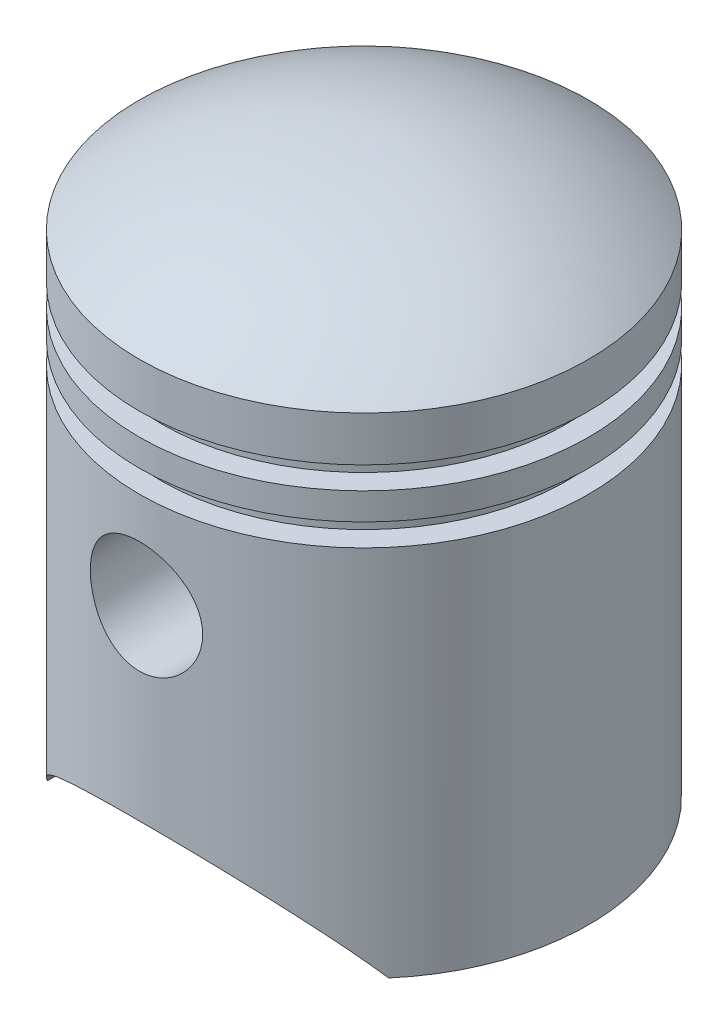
ISO-10303-21;
HEADER;
FILE_DESCRIPTION(('STEP AP214'),'2;1');
FILE_NAME('part.step','',(''),(''),'','','');
FILE_SCHEMA(('AUTOMOTIVE_DESIGN { 1 0 10303 214 1 1 1 1 }'));
ENDSEC;
DATA;
#1=APPLICATION_CONTEXT('core data for automotive mechanical design processes');
#2=APPLICATION_PROTOCOL_DEFINITION('international standard','automotive_design',2000,#1);
#3=PRODUCT_CONTEXT('',#1,'mechanical');
#4=PRODUCT('Part','Part','',(#3));
#5=PRODUCT_RELATED_PRODUCT_CATEGORY('part','',(#4));
#6=PRODUCT_DEFINITION_FORMATION('','',#4);
#7=PRODUCT_DEFINITION_CONTEXT('part definition',#1,'design');
#8=PRODUCT_DEFINITION('design','',#6,#7);
#9=PRODUCT_DEFINITION_SHAPE('','',#8);
#10=(LENGTH_UNIT() NAMED_UNIT(*) SI_UNIT(.MILLI.,.METRE.));
#11=(NAMED_UNIT(*) PLANE_ANGLE_UNIT() SI_UNIT($,.RADIAN.));
#12=(NAMED_UNIT(*) SI_UNIT($,.STERADIAN.) SOLID_ANGLE_UNIT());
#13=UNCERTAINTY_MEASURE_WITH_UNIT(LENGTH_MEASURE(1.E-05),#10,'distance_accuracy_value','');
#14=(GEOMETRIC_REPRESENTATION_CONTEXT(3) GLOBAL_UNCERTAINTY_ASSIGNED_CONTEXT((#13)) GLOBAL_UNIT_ASSIGNED_CONTEXT((#10,
#11,#12)) REPRESENTATION_CONTEXT('',''));
#15=CARTESIAN_POINT('',(0.,0.,0.));
#16=DIRECTION('',(0.,0.,1.));
#17=DIRECTION('',(1.,0.,0.));
#18=AXIS2_PLACEMENT_3D('',#15,#16,#17);
#19=CARTESIAN_POINT('',(0.,62.5,0.));
#20=DIRECTION('',(0.,1.,0.));
#21=DIRECTION('',(0.,0.,1.));
#22=AXIS2_PLACEMENT_3D('',#19,#20,#21);
#23=CYLINDRICAL_SURFACE('',#22,23.);
#24=CARTESIAN_POINT('',(7.25,30.6959678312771,-21.8274483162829));
#25=CARTESIAN_POINT('',(7.24999979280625,30.8940828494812,-21.8274484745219));
#26=CARTESIAN_POINT('',(7.24187256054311,31.0922012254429,-21.8301529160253));
#27=CARTESIAN_POINT('',(7.20944171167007,31.486964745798,-21.8408845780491));
#28=CARTESIAN_POINT('',(7.18513772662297,31.6836098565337,-21.8489119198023));
#29=CARTESIAN_POINT('',(7.12058229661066,32.0739915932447,-21.8700356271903));
#30=CARTESIAN_POINT('',(7.0803303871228,32.2677281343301,-21.8831321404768));
#31=CARTESIAN_POINT('',(6.9842299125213,32.6509827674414,-21.9139926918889));
#32=CARTESIAN_POINT('',(6.92837551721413,32.8404992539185,-21.9317584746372));
#33=CARTESIAN_POINT('',(6.80168925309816,33.2135519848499,-21.9713771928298));
#34=CARTESIAN_POINT('',(6.73089075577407,33.3971005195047,-21.9932210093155));
#35=CARTESIAN_POINT('',(6.57481072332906,33.7575001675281,-22.0403832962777));
#36=CARTESIAN_POINT('',(6.48952372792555,33.9343487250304,-22.0657030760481));
#37=CARTESIAN_POINT('',(6.21289883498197,34.4530566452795,-22.1458086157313));
#38=CARTESIAN_POINT('',(6.00068645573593,34.7834018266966,-22.2047768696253));
#39=CARTESIAN_POINT('',(5.51879231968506,35.4148817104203,-22.3294981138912));
#40=CARTESIAN_POINT('',(5.24750196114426,35.7147583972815,-22.3954069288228));
#41=CARTESIAN_POINT('',(4.80617720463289,36.1277180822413,-22.4927427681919));
#42=CARTESIAN_POINT('',(4.65323664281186,36.2592957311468,-22.5249521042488));
#43=CARTESIAN_POINT('',(4.33677293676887,36.5093586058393,-22.588014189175));
#44=CARTESIAN_POINT('',(4.17325378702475,36.6278487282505,-22.6188674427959));
#45=CARTESIAN_POINT('',(3.83266820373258,36.8535549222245,-22.6790931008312));
#46=CARTESIAN_POINT('',(3.65537366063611,36.9604404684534,-22.7084136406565));
#47=CARTESIAN_POINT('',(3.2919755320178,37.1588020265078,-22.7639333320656));
#48=CARTESIAN_POINT('',(3.10587522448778,37.2502837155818,-22.7901336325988));
#49=CARTESIAN_POINT('',(2.72609046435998,37.4171246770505,-22.8386749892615));
#50=CARTESIAN_POINT('',(2.53240594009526,37.4924837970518,-22.8610160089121));
#51=CARTESIAN_POINT('',(2.13886017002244,37.6264061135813,-22.9011875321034));
#52=CARTESIAN_POINT('',(1.9389991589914,37.6849699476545,-22.9190182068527));
#53=CARTESIAN_POINT('',(1.54095845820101,37.7831845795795,-22.9491617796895));
#54=CARTESIAN_POINT('',(1.34292261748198,37.8233709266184,-22.9616301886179));
#55=CARTESIAN_POINT('',(0.943940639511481,37.8870931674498,-22.9814896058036));
#56=CARTESIAN_POINT('',(0.742994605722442,37.9106296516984,-22.9888807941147));
#57=CARTESIAN_POINT('',(0.339752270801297,37.9408239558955,-22.9983746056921));
#58=CARTESIAN_POINT('',(0.137456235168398,37.9474850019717,-23.0004782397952));
#59=CARTESIAN_POINT('',(-0.266967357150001,37.9438722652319,-22.9993394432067));
#60=CARTESIAN_POINT('',(-0.469094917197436,37.9335988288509,-22.9960971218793));
#61=CARTESIAN_POINT('',(-0.864509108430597,37.896880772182,-22.9845678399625));
#62=CARTESIAN_POINT('',(-1.05785568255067,37.8710206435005,-22.9764632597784));
#63=CARTESIAN_POINT('',(-1.44165678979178,37.8038572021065,-22.9555782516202));
#64=CARTESIAN_POINT('',(-1.63211033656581,37.7625487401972,-22.9427962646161));
#65=CARTESIAN_POINT('',(-2.00869383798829,37.6648614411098,-22.9128963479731));
#66=CARTESIAN_POINT('',(-2.19482516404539,37.6084874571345,-22.8957798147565));
#67=CARTESIAN_POINT('',(-2.56167211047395,37.4811025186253,-22.857643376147));
#68=CARTESIAN_POINT('',(-2.74238566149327,37.4100860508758,-22.8366220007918));
#69=CARTESIAN_POINT('',(-3.09931161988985,37.2530431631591,-22.7909417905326));
#70=CARTESIAN_POINT('',(-3.27544415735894,37.1668471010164,-22.7662423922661));
#71=CARTESIAN_POINT('',(-3.61989047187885,36.9806504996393,-22.7140210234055));
#72=CARTESIAN_POINT('',(-3.78820154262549,36.8806452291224,-22.6864980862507));
#73=CARTESIAN_POINT('',(-4.11594618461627,36.6675418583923,-22.6293319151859));
#74=CARTESIAN_POINT('',(-4.27537940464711,36.5544432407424,-22.5996885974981));
#75=CARTESIAN_POINT('',(-4.58444018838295,36.3158893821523,-22.5390264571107));
#76=CARTESIAN_POINT('',(-4.73406743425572,36.1904337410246,-22.5080075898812));
#77=CARTESIAN_POINT('',(-5.02880209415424,35.9223436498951,-22.444038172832));
#78=CARTESIAN_POINT('',(-5.17344581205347,35.7792051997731,-22.4110616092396));
#79=CARTESIAN_POINT('',(-5.45017692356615,35.4812987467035,-22.345375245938));
#80=CARTESIAN_POINT('',(-5.58226829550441,35.3265344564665,-22.3126653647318));
#81=CARTESIAN_POINT('',(-5.83314895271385,35.0062204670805,-22.248396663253));
#82=CARTESIAN_POINT('',(-5.95193161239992,34.8406654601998,-22.2168384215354));
#83=CARTESIAN_POINT('',(-6.17525435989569,34.4999405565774,-22.1558036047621));
#84=CARTESIAN_POINT('',(-6.27979999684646,34.324774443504,-22.126326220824));
#85=CARTESIAN_POINT('',(-6.47509668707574,33.9637267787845,-22.0699701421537));
#86=CARTESIAN_POINT('',(-6.56566699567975,33.7777418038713,-22.0431269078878));
#87=CARTESIAN_POINT('',(-6.73070882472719,33.3983437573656,-21.9932942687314));
#88=CARTESIAN_POINT('',(-6.80518655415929,33.2049335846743,-21.9703033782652));
#89=CARTESIAN_POINT('',(-6.93741988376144,32.8120175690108,-21.9289080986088));
#90=CARTESIAN_POINT('',(-6.99517718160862,32.6125123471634,-21.9105032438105));
#91=CARTESIAN_POINT('',(-7.09342611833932,32.2088922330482,-21.8788933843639));
#92=CARTESIAN_POINT('',(-7.13391853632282,32.0047775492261,-21.8656881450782));
#93=CARTESIAN_POINT('',(-7.19593865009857,31.6019413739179,-21.8453538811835));
#94=CARTESIAN_POINT('',(-7.21817305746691,31.4033398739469,-21.8379988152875));
#95=CARTESIAN_POINT('',(-7.24616992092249,31.0048547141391,-21.8287251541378));
#96=CARTESIAN_POINT('',(-7.25193287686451,30.804971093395,-21.8268063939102));
#97=CARTESIAN_POINT('',(-7.24693112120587,30.4054631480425,-21.8284675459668));
#98=CARTESIAN_POINT('',(-7.23616873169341,30.2058387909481,-21.832046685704));
#99=CARTESIAN_POINT('',(-7.19822621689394,29.8083296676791,-21.8445859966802));
#100=CARTESIAN_POINT('',(-7.17104625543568,29.6104448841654,-21.8535461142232));
#101=CARTESIAN_POINT('',(-7.10158312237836,29.2237406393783,-21.8762155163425));
#102=CARTESIAN_POINT('',(-7.05977458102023,29.034826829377,-21.8897751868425));
#103=CARTESIAN_POINT('',(-6.96129649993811,28.6612238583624,-21.9212915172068));
#104=CARTESIAN_POINT('',(-6.90462201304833,28.4765361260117,-21.9392496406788));
#105=CARTESIAN_POINT('',(-6.77689595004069,28.1126850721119,-21.9790388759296));
#106=CARTESIAN_POINT('',(-6.70584771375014,27.9335204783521,-22.0008690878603));
#107=CARTESIAN_POINT('',(-6.54987833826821,27.5817046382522,-22.0478054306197));
#108=CARTESIAN_POINT('',(-6.4649519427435,27.4090558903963,-22.0729128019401));
#109=CARTESIAN_POINT('',(-6.27921382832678,27.0665028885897,-22.1264791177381));
#110=CARTESIAN_POINT('',(-6.17801599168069,26.8968197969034,-22.15501359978));
#111=CARTESIAN_POINT('',(-5.96226037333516,26.5664533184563,-22.21404870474));
#112=CARTESIAN_POINT('',(-5.84769797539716,26.4057730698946,-22.2445500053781));
#113=CARTESIAN_POINT('',(-5.60597613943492,26.0944052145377,-22.3066940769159));
#114=CARTESIAN_POINT('',(-5.47881589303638,25.943718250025,-22.3383369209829));
#115=CARTESIAN_POINT('',(-5.2126862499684,25.6532298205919,-22.4019333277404));
#116=CARTESIAN_POINT('',(-5.07371662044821,25.513428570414,-22.4338868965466));
#117=CARTESIAN_POINT('',(-4.77864394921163,25.2398482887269,-22.498629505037));
#118=CARTESIAN_POINT('',(-4.6220636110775,25.1065781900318,-22.5313962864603));
#119=CARTESIAN_POINT('',(-4.29801720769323,24.8537277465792,-22.5954489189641));
#120=CARTESIAN_POINT('',(-4.13055483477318,24.7341427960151,-22.6267352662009));
#121=CARTESIAN_POINT('',(-3.78570638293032,24.509426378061,-22.6869801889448));
#122=CARTESIAN_POINT('',(-3.60831668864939,24.4043002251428,-22.715937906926));
#123=CARTESIAN_POINT('',(-3.24491682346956,24.2094043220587,-22.7706885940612));
#124=CARTESIAN_POINT('',(-3.05891027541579,24.1196281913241,-22.7964828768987));
#125=CARTESIAN_POINT('',(-2.68079668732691,23.9566863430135,-22.8440228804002));
#126=CARTESIAN_POINT('',(-2.4887405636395,23.883410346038,-22.8657952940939));
#127=CARTESIAN_POINT('',(-2.09876068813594,23.753350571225,-22.9048812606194));
#128=CARTESIAN_POINT('',(-1.90083928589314,23.6965602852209,-22.9221965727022));
#129=CARTESIAN_POINT('',(-1.50054062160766,23.5999642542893,-22.9518768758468));
#130=CARTESIAN_POINT('',(-1.29816365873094,23.5601573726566,-22.9642421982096));
#131=CARTESIAN_POINT('',(-0.890506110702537,23.4979119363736,-22.9836600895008));
#132=CARTESIAN_POINT('',(-0.685225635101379,23.4754727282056,-22.9907128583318));
#133=CARTESIAN_POINT('',(-0.282114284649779,23.4487634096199,-22.9991156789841));
#134=CARTESIAN_POINT('',(-0.0843361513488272,23.443763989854,-23.0006946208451));
#135=CARTESIAN_POINT('',(0.310940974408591,23.4499424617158,-22.9987472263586));
#136=CARTESIAN_POINT('',(0.508439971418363,23.4611200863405,-22.9952209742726));
#137=CARTESIAN_POINT('',(0.901695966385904,23.4995468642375,-22.9831599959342));
#138=CARTESIAN_POINT('',(1.09745309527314,23.5267947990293,-22.974625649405));
#139=CARTESIAN_POINT('',(1.48583207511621,23.5971123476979,-22.9527805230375));
#140=CARTESIAN_POINT('',(1.67845391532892,23.6401820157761,-22.9394697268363));
#141=CARTESIAN_POINT('',(2.05670920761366,23.7410947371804,-22.9086334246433));
#142=CARTESIAN_POINT('',(2.24240122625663,23.7987362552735,-22.8911655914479));
#143=CARTESIAN_POINT('',(2.60826259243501,23.9286079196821,-22.8523701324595));
#144=CARTESIAN_POINT('',(2.78843006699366,24.0008429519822,-22.8310412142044));
#145=CARTESIAN_POINT('',(3.14200770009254,24.1593162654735,-22.7850733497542));
#146=CARTESIAN_POINT('',(3.31541927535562,24.2455515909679,-22.7604351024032));
#147=CARTESIAN_POINT('',(3.6545422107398,24.4314465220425,-22.7084513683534));
#148=CARTESIAN_POINT('',(3.82025078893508,24.5311109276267,-22.6811049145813));
#149=CARTESIAN_POINT('',(4.14845739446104,24.7467943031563,-22.6234171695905));
#150=CARTESIAN_POINT('',(4.31065247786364,24.8632555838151,-22.5930054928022));
#151=CARTESIAN_POINT('',(4.62473329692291,25.1090092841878,-22.5308117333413));
#152=CARTESIAN_POINT('',(4.77661871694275,25.2383020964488,-22.4990296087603));
#153=CARTESIAN_POINT('',(5.06923202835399,25.5089530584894,-22.4349132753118));
#154=CARTESIAN_POINT('',(5.20995494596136,25.6503165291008,-22.4025788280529));
#155=CARTESIAN_POINT('',(5.47926717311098,25.9441434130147,-22.3382362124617));
#156=CARTESIAN_POINT('',(5.6078604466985,26.0966031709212,-22.3062279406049));
#157=CARTESIAN_POINT('',(5.85635308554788,26.4171651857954,-22.2423054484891));
#158=CARTESIAN_POINT('',(5.97580263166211,26.5856247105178,-22.2104321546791));
#159=CARTESIAN_POINT('',(6.20001900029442,26.9323432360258,-22.1488889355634));
#160=CARTESIAN_POINT('',(6.30479110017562,27.110598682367,-22.1192182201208));
#161=CARTESIAN_POINT('',(6.4988912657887,27.4757717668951,-22.0629695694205));
#162=CARTESIAN_POINT('',(6.58822124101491,27.6626883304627,-22.0363912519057));
#163=CARTESIAN_POINT('',(6.75070752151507,28.0439171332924,-21.9871590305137));
#164=CARTESIAN_POINT('',(6.82386510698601,28.2382287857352,-21.9645048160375));
#165=CARTESIAN_POINT('',(6.94814974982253,28.616980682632,-21.9254899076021));
#166=CARTESIAN_POINT('',(7.00057498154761,28.8009588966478,-21.9087697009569));
#167=CARTESIAN_POINT('',(7.09079370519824,29.1728883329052,-21.8797371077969));
#168=CARTESIAN_POINT('',(7.12858196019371,29.3608409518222,-21.8674262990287));
#169=CARTESIAN_POINT('',(7.18916722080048,29.7393577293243,-21.8475832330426));
#170=CARTESIAN_POINT('',(7.21196740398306,29.9299213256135,-21.8400499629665));
#171=CARTESIAN_POINT('',(7.24238087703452,30.3123118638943,-21.8299834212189));
#172=CARTESIAN_POINT('',(7.25000020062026,30.5041382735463,-21.8274481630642));
#173=CARTESIAN_POINT('',(7.25,30.6959678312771,-21.8274483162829));
#174=B_SPLINE_CURVE_WITH_KNOTS('',3,(#24,#25,#26,#27,#28,#29,#30,#31,#32,#33,#34,#35,#36,#37,
#38,#39,#40,#41,#42,#43,#44,#45,#46,#47,#48,#49,#50,#51,#52,#53,#54,#55,#56,#57,#58,#59,#60,#61,
#62,#63,#64,#65,#66,#67,#68,#69,#70,#71,#72,#73,#74,#75,#76,#77,#78,#79,#80,#81,#82,#83,#84,#85,
#86,#87,#88,#89,#90,#91,#92,#93,#94,#95,#96,#97,#98,#99,#100,#101,#102,#103,#104,#105,#106,#107,
#108,#109,#110,#111,#112,#113,#114,#115,#116,#117,#118,#119,#120,#121,#122,#123,#124,#125,#126,
#127,#128,#129,#130,#131,#132,#133,#134,#135,#136,#137,#138,#139,#140,#141,#142,#143,#144,#145,
#146,#147,#148,#149,#150,#151,#152,#153,#154,#155,#156,#157,#158,#159,#160,#161,#162,#163,#164,
#165,#166,#167,#168,#169,#170,#171,#172,#173),.UNSPECIFIED.,.T.,.F.,(4,2,2,2,2,2,2,2,2,2,2,2,2,
2,2,2,2,2,2,2,2,2,2,2,2,2,2,2,2,2,2,2,2,2,2,2,2,2,2,2,2,2,2,2,2,2,2,2,2,2,2,2,2,2,2,2,2,2,2,2,2,
2,2,2,2,2,2,2,2,2,2,2,2,2,4),(0.,0.594166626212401,1.1883467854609,1.78254425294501,
2.37696405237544,2.97007024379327,3.56340045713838,4.74904176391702,5.97226985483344,
6.58460954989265,7.19671935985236,7.82321916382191,8.44948755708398,9.07576186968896,
9.70201240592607,10.3086224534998,10.9152109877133,11.5216835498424,12.1281437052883,
12.7131654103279,13.2983822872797,13.8834108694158,14.468660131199,15.0609213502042,
15.6533859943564,16.2458740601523,16.8383813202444,17.4561161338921,18.0736545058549,
18.691498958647,19.3091019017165,19.9341219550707,20.5589004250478,21.183615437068,
21.8083022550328,22.4074876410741,23.0066548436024,23.6057378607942,24.2048148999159,
24.7860244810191,25.3674277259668,25.9486960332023,26.5301850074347,27.1283712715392,
27.7267647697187,28.3251966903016,28.9236404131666,29.5475337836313,30.1712165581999,
30.7951279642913,31.4187793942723,32.038129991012,32.6572357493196,33.2763000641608,
33.8953410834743,34.4881621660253,35.0809734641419,35.6737398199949,36.2665082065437,
36.8514884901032,37.4366649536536,38.0217180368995,38.6069807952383,39.2122323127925,
39.8175023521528,40.4230405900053,41.028380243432,41.6544944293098,42.2803829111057,
42.9061939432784,43.5319554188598,44.1074165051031,44.6830832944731,45.2586279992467,
45.8339439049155),.UNSPECIFIED.);
#175=CARTESIAN_POINT('',(7.25,30.6959678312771,-21.8274483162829));
#176=VERTEX_POINT('',#175);
#177=EDGE_CURVE('E248',#176,#176,#174,.T.);
#178=ORIENTED_EDGE('',*,*,#177,.F.);
#179=EDGE_LOOP('',(#178));
#180=FACE_BOUND('',#179,.T.);
#181=CARTESIAN_POINT('',(-19.,0.,12.9614813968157));
#182=CARTESIAN_POINT('',(-18.8240362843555,0.256532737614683,13.2194131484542));
#183=CARTESIAN_POINT('',(-18.6418617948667,0.510998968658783,13.4751861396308));
#184=CARTESIAN_POINT('',(-18.2648425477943,1.01532330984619,13.9819654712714));
#185=CARTESIAN_POINT('',(-18.0699962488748,1.26518085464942,14.232971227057));
#186=CARTESIAN_POINT('',(-17.667027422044,1.76024137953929,14.7301974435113));
#187=CARTESIAN_POINT('',(-17.4588792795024,2.00543412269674,14.9764074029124));
#188=CARTESIAN_POINT('',(-17.02947047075,2.49004463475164,15.4629377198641));
#189=CARTESIAN_POINT('',(-16.8082099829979,2.72946248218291,15.7032581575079));
#190=CARTESIAN_POINT('',(-16.1193103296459,3.44343188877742,16.4198067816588));
#191=CARTESIAN_POINT('',(-15.6309190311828,3.90829134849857,16.8861914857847));
#192=CARTESIAN_POINT('',(-14.8567156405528,4.58122686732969,17.5611822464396));
#193=CARTESIAN_POINT('',(-14.5918116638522,4.80140702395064,17.7820085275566));
#194=CARTESIAN_POINT('',(-14.0478204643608,5.23299249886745,18.2148173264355));
#195=CARTESIAN_POINT('',(-13.7687300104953,5.44439579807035,18.4267978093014));
#196=CARTESIAN_POINT('',(-13.0738245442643,5.94586727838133,18.92959548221));
#197=CARTESIAN_POINT('',(-12.6506180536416,6.23087659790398,19.2153216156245));
#198=CARTESIAN_POINT('',(-11.7755226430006,6.77792627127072,19.7636939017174));
#199=CARTESIAN_POINT('',(-11.3236415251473,7.03997282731,20.0263462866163));
#200=CARTESIAN_POINT('',(-10.3934517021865,7.53697590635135,20.5244596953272));
#201=CARTESIAN_POINT('',(-9.91524700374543,7.77202910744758,20.760017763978));
#202=CARTESIAN_POINT('',(-8.93227707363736,8.21261421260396,21.2015222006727));
#203=CARTESIAN_POINT('',(-8.42751653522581,8.4181513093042,21.4074737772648));
#204=CARTESIAN_POINT('',(-7.4760087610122,8.76599336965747,21.7560008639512));
#205=CARTESIAN_POINT('',(-7.03281710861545,8.91315566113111,21.9034461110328));
#206=CARTESIAN_POINT('',(-6.13115145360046,9.18193833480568,22.1727371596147));
#207=CARTESIAN_POINT('',(-5.67267887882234,9.30356109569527,22.2945853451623));
#208=CARTESIAN_POINT('',(-4.74282717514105,9.51932143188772,22.5107406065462));
#209=CARTESIAN_POINT('',(-4.27144595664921,9.61345452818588,22.6050431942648));
#210=CARTESIAN_POINT('',(-3.31887419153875,9.77253466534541,22.7644073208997));
#211=CARTESIAN_POINT('',(-2.83768355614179,9.83748144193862,22.8294685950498));
#212=CARTESIAN_POINT('',(-1.86721019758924,9.93712785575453,22.9292898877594));
#213=CARTESIAN_POINT('',(-1.37790400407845,9.97171389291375,22.9639361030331));
#214=CARTESIAN_POINT('',(-0.396859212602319,10.0095263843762,23.0018143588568));
#215=CARTESIAN_POINT('',(0.0948793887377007,10.0127527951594,23.0050463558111));
#216=CARTESIAN_POINT('',(1.0767337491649,9.98778065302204,22.9800308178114));
#217=CARTESIAN_POINT('',(1.56684955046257,9.95958292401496,22.9517841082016));
#218=CARTESIAN_POINT('',(2.54152223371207,9.87233577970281,22.8643842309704));
#219=CARTESIAN_POINT('',(3.02607924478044,9.81328708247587,22.805231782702));
#220=CARTESIAN_POINT('',(3.95596098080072,9.67012136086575,22.6618115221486));
#221=CARTESIAN_POINT('',(4.40184450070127,9.58780240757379,22.5793451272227));
#222=CARTESIAN_POINT('',(5.28288157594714,9.39840205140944,22.389600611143));
#223=CARTESIAN_POINT('',(5.71803589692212,9.29132242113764,22.2823242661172));
#224=CARTESIAN_POINT('',(6.57532251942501,9.05400950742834,22.0445675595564));
#225=CARTESIAN_POINT('',(6.99745851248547,8.9237828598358,21.9140938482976));
#226=CARTESIAN_POINT('',(7.82715444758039,8.64187428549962,21.6316390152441));
#227=CARTESIAN_POINT('',(8.23471132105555,8.49018787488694,21.4796533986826));
#228=CARTESIAN_POINT('',(9.17667076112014,8.10943151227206,21.0981274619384));
#229=CARTESIAN_POINT('',(9.7043851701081,7.87207344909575,20.8602760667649));
#230=CARTESIAN_POINT('',(10.728278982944,7.36555464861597,20.3526616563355));
#231=CARTESIAN_POINT('',(11.2244482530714,7.09638377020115,20.0828884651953));
#232=CARTESIAN_POINT('',(12.1858864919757,6.52936231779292,19.5145386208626));
#233=CARTESIAN_POINT('',(12.6510285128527,6.23140483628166,19.2158545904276));
#234=CARTESIAN_POINT('',(13.5480075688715,5.61147898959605,18.5943359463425));
#235=CARTESIAN_POINT('',(13.9798379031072,5.28950581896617,18.2714964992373));
#236=CARTESIAN_POINT('',(14.8621044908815,4.58352080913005,17.5634971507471));
#237=CARTESIAN_POINT('',(15.3081442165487,4.1967798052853,17.1755864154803));
#238=CARTESIAN_POINT('',(16.1590879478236,3.40134268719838,16.3775550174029));
#239=CARTESIAN_POINT('',(16.563976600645,2.99263846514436,15.9674261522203));
#240=CARTESIAN_POINT('',(17.3294472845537,2.16135740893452,15.1329895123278));
#241=CARTESIAN_POINT('',(17.6904534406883,1.73897352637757,14.7088780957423));
#242=CARTESIAN_POINT('',(18.2030315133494,1.09447948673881,14.0614832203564));
#243=CARTESIAN_POINT('',(18.3689990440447,0.877930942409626,13.8439166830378));
#244=CARTESIAN_POINT('',(18.6915170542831,0.441440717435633,13.4052694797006));
#245=CARTESIAN_POINT('',(18.848068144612,0.221499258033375,13.1841890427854));
#246=CARTESIAN_POINT('',(19.,0.,12.9614813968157));
#247=B_SPLINE_CURVE_WITH_KNOTS('',3,(#181,#182,#183,#184,#185,#186,#187,#188,#189,#190,#191,
#192,#193,#194,#195,#196,#197,#198,#199,#200,#201,#202,#203,#204,#205,#206,#207,#208,#209,#210,
#211,#212,#213,#214,#215,#216,#217,#218,#219,#220,#221,#222,#223,#224,#225,#226,#227,#228,#229,
#230,#231,#232,#233,#234,#235,#236,#237,#238,#239,#240,#241,#242,#243,#244,#245,#246),
.UNSPECIFIED.,.F.,.F.,(4,2,2,2,2,2,2,2,2,2,2,2,2,2,2,2,2,2,2,2,2,2,2,2,2,2,2,2,2,2,2,2,4),(0.,
1.21227592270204,2.42469957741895,3.63953271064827,4.85434931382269,7.31037698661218,
8.53753293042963,9.76496963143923,11.517769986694,13.270095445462,15.0159350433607,
16.7614671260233,18.2291389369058,19.6966739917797,21.1644480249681,22.63223534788,
24.1054915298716,25.5787497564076,27.0519693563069,28.525154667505,29.9062367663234,
31.2872200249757,32.6678080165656,34.0486848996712,35.9227816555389,37.7974774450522,
39.6794246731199,41.5617494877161,43.6788358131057,45.7967091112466,47.8921348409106,
48.9388815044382,49.985560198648),.UNSPECIFIED.);
#248=CARTESIAN_POINT('',(-19.,0.,12.9614813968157));
#249=VERTEX_POINT('',#248);
#250=CARTESIAN_POINT('',(19.,0.,12.9614813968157));
#251=VERTEX_POINT('',#250);
#252=EDGE_CURVE('E101',#249,#251,#247,.T.);
#253=ORIENTED_EDGE('',*,*,#252,.F.);
#254=CARTESIAN_POINT('',(0.,0.,0.));
#255=DIRECTION('',(0.,1.,0.));
#256=DIRECTION('',(0.,0.,1.));
#257=AXIS2_PLACEMENT_3D('',#254,#255,#256);
#258=CIRCLE('',#257,23.);
#259=CARTESIAN_POINT('',(-19.,0.,-12.9614813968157));
#260=VERTEX_POINT('',#259);
#261=EDGE_CURVE('E108',#260,#249,#258,.T.);
#262=ORIENTED_EDGE('',*,*,#261,.F.);
#263=CARTESIAN_POINT('',(19.,0.,-12.9614813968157));
#264=CARTESIAN_POINT('',(18.8240362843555,0.256532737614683,-13.2194131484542));
#265=CARTESIAN_POINT('',(18.6418617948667,0.510998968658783,-13.4751861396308));
#266=CARTESIAN_POINT('',(18.2648425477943,1.01532330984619,-13.9819654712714));
#267=CARTESIAN_POINT('',(18.0699962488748,1.26518085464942,-14.232971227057));
#268=CARTESIAN_POINT('',(17.667027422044,1.76024137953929,-14.7301974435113));
#269=CARTESIAN_POINT('',(17.4588792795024,2.00543412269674,-14.9764074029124));
#270=CARTESIAN_POINT('',(17.02947047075,2.49004463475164,-15.4629377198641));
#271=CARTESIAN_POINT('',(16.8082099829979,2.72946248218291,-15.7032581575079));
#272=CARTESIAN_POINT('',(16.1193103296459,3.44343188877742,-16.4198067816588));
#273=CARTESIAN_POINT('',(15.6309190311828,3.90829134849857,-16.8861914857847));
#274=CARTESIAN_POINT('',(14.8567156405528,4.58122686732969,-17.5611822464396));
#275=CARTESIAN_POINT('',(14.5918116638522,4.80140702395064,-17.7820085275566));
#276=CARTESIAN_POINT('',(14.0478204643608,5.23299249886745,-18.2148173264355));
#277=CARTESIAN_POINT('',(13.7687300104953,5.44439579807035,-18.4267978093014));
#278=CARTESIAN_POINT('',(13.0738245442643,5.94586727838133,-18.92959548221));
#279=CARTESIAN_POINT('',(12.6506180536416,6.23087659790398,-19.2153216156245));
#280=CARTESIAN_POINT('',(11.7755226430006,6.77792627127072,-19.7636939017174));
#281=CARTESIAN_POINT('',(11.3236415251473,7.03997282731,-20.0263462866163));
#282=CARTESIAN_POINT('',(10.3934517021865,7.53697590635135,-20.5244596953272));
#283=CARTESIAN_POINT('',(9.91524700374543,7.77202910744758,-20.760017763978));
#284=CARTESIAN_POINT('',(8.93227707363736,8.21261421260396,-21.2015222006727));
#285=CARTESIAN_POINT('',(8.42751653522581,8.4181513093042,-21.4074737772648));
#286=CARTESIAN_POINT('',(7.4760087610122,8.76599336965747,-21.7560008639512));
#287=CARTESIAN_POINT('',(7.03281710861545,8.91315566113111,-21.9034461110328));
#288=CARTESIAN_POINT('',(6.13115145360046,9.18193833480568,-22.1727371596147));
#289=CARTESIAN_POINT('',(5.67267887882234,9.30356109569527,-22.2945853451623));
#290=CARTESIAN_POINT('',(4.74282717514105,9.51932143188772,-22.5107406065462));
#291=CARTESIAN_POINT('',(4.27144595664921,9.61345452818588,-22.6050431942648));
#292=CARTESIAN_POINT('',(3.31887419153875,9.77253466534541,-22.7644073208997));
#293=CARTESIAN_POINT('',(2.83768355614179,9.83748144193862,-22.8294685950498));
#294=CARTESIAN_POINT('',(1.86721019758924,9.93712785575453,-22.9292898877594));
#295=CARTESIAN_POINT('',(1.37790400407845,9.97171389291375,-22.9639361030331));
#296=CARTESIAN_POINT('',(0.396859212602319,10.0095263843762,-23.0018143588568));
#297=CARTESIAN_POINT('',(-0.0948793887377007,10.0127527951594,-23.0050463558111));
#298=CARTESIAN_POINT('',(-1.0767337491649,9.98778065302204,-22.9800308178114));
#299=CARTESIAN_POINT('',(-1.56684955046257,9.95958292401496,-22.9517841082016));
#300=CARTESIAN_POINT('',(-2.54152223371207,9.87233577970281,-22.8643842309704));
#301=CARTESIAN_POINT('',(-3.02607924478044,9.81328708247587,-22.805231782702));
#302=CARTESIAN_POINT('',(-3.95596098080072,9.67012136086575,-22.6618115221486));
#303=CARTESIAN_POINT('',(-4.40184450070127,9.58780240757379,-22.5793451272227));
#304=CARTESIAN_POINT('',(-5.28288157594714,9.39840205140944,-22.389600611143));
#305=CARTESIAN_POINT('',(-5.71803589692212,9.29132242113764,-22.2823242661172));
#306=CARTESIAN_POINT('',(-6.57532251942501,9.05400950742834,-22.0445675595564));
#307=CARTESIAN_POINT('',(-6.99745851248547,8.9237828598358,-21.9140938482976));
#308=CARTESIAN_POINT('',(-7.82715444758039,8.64187428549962,-21.6316390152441));
#309=CARTESIAN_POINT('',(-8.23471132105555,8.49018787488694,-21.4796533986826));
#310=CARTESIAN_POINT('',(-9.17667076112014,8.10943151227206,-21.0981274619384));
#311=CARTESIAN_POINT('',(-9.7043851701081,7.87207344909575,-20.8602760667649));
#312=CARTESIAN_POINT('',(-10.728278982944,7.36555464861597,-20.3526616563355));
#313=CARTESIAN_POINT('',(-11.2244482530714,7.09638377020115,-20.0828884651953));
#314=CARTESIAN_POINT('',(-12.1858864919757,6.52936231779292,-19.5145386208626));
#315=CARTESIAN_POINT('',(-12.6510285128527,6.23140483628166,-19.2158545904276));
#316=CARTESIAN_POINT('',(-13.5480075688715,5.61147898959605,-18.5943359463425));
#317=CARTESIAN_POINT('',(-13.9798379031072,5.28950581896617,-18.2714964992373));
#318=CARTESIAN_POINT('',(-14.8621044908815,4.58352080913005,-17.5634971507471));
#319=CARTESIAN_POINT('',(-15.3081442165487,4.1967798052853,-17.1755864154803));
#320=CARTESIAN_POINT('',(-16.1590879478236,3.40134268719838,-16.3775550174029));
#321=CARTESIAN_POINT('',(-16.563976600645,2.99263846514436,-15.9674261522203));
#322=CARTESIAN_POINT('',(-17.3294472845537,2.16135740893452,-15.1329895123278));
#323=CARTESIAN_POINT('',(-17.6904534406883,1.73897352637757,-14.7088780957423));
#324=CARTESIAN_POINT('',(-18.2030315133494,1.09447948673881,-14.0614832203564));
#325=CARTESIAN_POINT('',(-18.3689990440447,0.877930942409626,-13.8439166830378));
#326=CARTESIAN_POINT('',(-18.6915170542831,0.441440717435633,-13.4052694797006));
#327=CARTESIAN_POINT('',(-18.848068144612,0.221499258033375,-13.1841890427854));
#328=CARTESIAN_POINT('',(-19.,0.,-12.9614813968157));
#329=B_SPLINE_CURVE_WITH_KNOTS('',3,(#263,#264,#265,#266,#267,#268,#269,#270,#271,#272,#273,
#274,#275,#276,#277,#278,#279,#280,#281,#282,#283,#284,#285,#286,#287,#288,#289,#290,#291,#292,
#293,#294,#295,#296,#297,#298,#299,#300,#301,#302,#303,#304,#305,#306,#307,#308,#309,#310,#311,
#312,#313,#314,#315,#316,#317,#318,#319,#320,#321,#322,#323,#324,#325,#326,#327,#328),
.UNSPECIFIED.,.F.,.F.,(4,2,2,2,2,2,2,2,2,2,2,2,2,2,2,2,2,2,2,2,2,2,2,2,2,2,2,2,2,2,2,2,4),(0.,
1.21227592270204,2.42469957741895,3.63953271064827,4.85434931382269,7.31037698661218,
8.53753293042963,9.76496963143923,11.517769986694,13.270095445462,15.0159350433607,
16.7614671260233,18.2291389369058,19.6966739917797,21.1644480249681,22.63223534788,
24.1054915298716,25.5787497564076,27.0519693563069,28.525154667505,29.9062367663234,
31.2872200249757,32.6678080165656,34.0486848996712,35.9227816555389,37.7974774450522,
39.6794246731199,41.5617494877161,43.6788358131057,45.7967091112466,47.8921348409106,
48.9388815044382,49.985560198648),.UNSPECIFIED.);
#330=CARTESIAN_POINT('',(19.,0.,-12.9614813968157));
#331=VERTEX_POINT('',#330);
#332=EDGE_CURVE('E93',#331,#260,#329,.T.);
#333=ORIENTED_EDGE('',*,*,#332,.F.);
#334=EDGE_CURVE('E115',#251,#331,#258,.T.);
#335=ORIENTED_EDGE('',*,*,#334,.F.);
#336=EDGE_LOOP('',(#253,#262,#333,#335));
#337=FACE_BOUND('',#336,.T.);
#338=CARTESIAN_POINT('',(0.,39.5,0.));
#339=DIRECTION('',(0.,1.,0.));
#340=DIRECTION('',(0.,0.,1.));
#341=AXIS2_PLACEMENT_3D('',#338,#339,#340);
#342=CIRCLE('',#341,23.);
#343=CARTESIAN_POINT('',(0.,39.5,23.));
#344=VERTEX_POINT('',#343);
#345=EDGE_CURVE('E118',#344,#344,#342,.T.);
#346=ORIENTED_EDGE('',*,*,#345,.T.);
#347=EDGE_LOOP('',(#346));
#348=FACE_BOUND('',#347,.T.);
#349=CARTESIAN_POINT('',(0.,23.4459678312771,23.));
#350=CARTESIAN_POINT('',(-0.198391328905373,23.4459680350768,22.9999998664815));
#351=CARTESIAN_POINT('',(-0.396785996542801,23.4541177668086,22.9974270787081));
#352=CARTESIAN_POINT('',(-0.792110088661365,23.4866405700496,22.9872065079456));
#353=CARTESIAN_POINT('',(-0.9890394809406,23.5110139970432,22.9795586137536));
#354=CARTESIAN_POINT('',(-1.37999378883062,23.575758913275,22.9593974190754));
#355=CARTESIAN_POINT('',(-1.57401873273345,23.6161302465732,22.9468841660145));
#356=CARTESIAN_POINT('',(-1.95785729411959,23.7125251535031,22.9173268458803));
#357=CARTESIAN_POINT('',(-2.14766932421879,23.7685545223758,22.9002811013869));
#358=CARTESIAN_POINT('',(-2.52135229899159,23.8956632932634,22.8621514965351));
#359=CARTESIAN_POINT('',(-2.70523423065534,23.9667127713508,22.8410756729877));
#360=CARTESIAN_POINT('',(-3.06627446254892,24.1233550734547,22.7954194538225));
#361=CARTESIAN_POINT('',(-3.24343020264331,24.2089533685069,22.7708377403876));
#362=CARTESIAN_POINT('',(-3.76298256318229,24.4865867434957,22.6927785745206));
#363=CARTESIAN_POINT('',(-4.09379753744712,24.6995743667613,22.6349513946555));
#364=CARTESIAN_POINT('',(-4.72483685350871,25.1822869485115,22.51182903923));
#365=CARTESIAN_POINT('',(-5.02393219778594,25.4534454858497,22.4463689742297));
#366=CARTESIAN_POINT('',(-5.43574189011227,25.8943210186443,22.3488863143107));
#367=CARTESIAN_POINT('',(-5.56694191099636,26.0470731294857,22.3164903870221));
#368=CARTESIAN_POINT('',(-5.81627300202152,26.3630799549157,22.2528086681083));
#369=CARTESIAN_POINT('',(-5.93440890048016,26.5263307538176,22.2215224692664));
#370=CARTESIAN_POINT('',(-6.15968279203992,26.8666691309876,22.1601511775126));
#371=CARTESIAN_POINT('',(-6.26646049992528,27.0440043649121,22.1301175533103));
#372=CARTESIAN_POINT('',(-6.46460322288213,27.407469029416,22.0730499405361));
#373=CARTESIAN_POINT('',(-6.55597391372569,27.5935951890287,22.0460148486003));
#374=CARTESIAN_POINT('',(-6.72259565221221,27.9734292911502,21.9957788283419));
#375=CARTESIAN_POINT('',(-6.79784693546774,28.167137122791,21.9725778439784));
#376=CARTESIAN_POINT('',(-6.93155967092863,28.5607451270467,21.9307636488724));
#377=CARTESIAN_POINT('',(-6.99002179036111,28.7606450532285,21.9121502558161));
#378=CARTESIAN_POINT('',(-7.08807719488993,29.1589471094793,21.8806246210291));
#379=CARTESIAN_POINT('',(-7.12819246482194,29.3572083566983,21.8675555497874));
#380=CARTESIAN_POINT('',(-7.1917381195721,29.7566605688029,21.8467394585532));
#381=CARTESIAN_POINT('',(-7.21516917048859,29.9578514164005,21.8389922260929));
#382=CARTESIAN_POINT('',(-7.24511213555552,30.3615803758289,21.8290769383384));
#383=CARTESIAN_POINT('',(-7.25162784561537,30.5641181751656,21.8269076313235));
#384=CARTESIAN_POINT('',(-7.24768473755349,30.9690074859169,21.8282173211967));
#385=CARTESIAN_POINT('',(-7.23722633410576,31.1713590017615,21.8316961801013));
#386=CARTESIAN_POINT('',(-7.20020948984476,31.56612997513,21.8439314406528));
#387=CARTESIAN_POINT('',(-7.17432091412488,31.7586195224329,21.8524681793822));
#388=CARTESIAN_POINT('',(-7.10724173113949,32.1406989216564,21.8743767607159));
#389=CARTESIAN_POINT('',(-7.06604604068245,32.3302877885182,21.887750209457));
#390=CARTESIAN_POINT('',(-6.96872621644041,32.705158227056,21.9189292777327));
#391=CARTESIAN_POINT('',(-6.91260633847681,32.8904410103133,21.9367336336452));
#392=CARTESIAN_POINT('',(-6.78587045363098,33.2556227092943,21.9762682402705));
#393=CARTESIAN_POINT('',(-6.71524895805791,33.4355195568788,21.9979999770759));
#394=CARTESIAN_POINT('',(-6.55894468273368,33.7912932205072,22.0451128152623));
#395=CARTESIAN_POINT('',(-6.4730593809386,33.9670746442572,22.0705420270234));
#396=CARTESIAN_POINT('',(-6.28754062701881,34.3108676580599,22.1241079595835));
#397=CARTESIAN_POINT('',(-6.18790246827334,34.4788765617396,22.1522456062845));
#398=CARTESIAN_POINT('',(-5.97557258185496,34.806086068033,22.2104625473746));
#399=CARTESIAN_POINT('',(-5.86288022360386,34.965286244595,22.2405419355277));
#400=CARTESIAN_POINT('',(-5.62516083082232,35.2739604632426,22.3018526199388));
#401=CARTESIAN_POINT('',(-5.50013340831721,35.423434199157,22.3330839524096));
#402=CARTESIAN_POINT('',(-5.23239740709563,35.7185201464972,22.3973622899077));
#403=CARTESIAN_POINT('',(-5.08913646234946,35.8636280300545,22.4304260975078));
#404=CARTESIAN_POINT('',(-4.79088924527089,36.1412757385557,22.4960148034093));
#405=CARTESIAN_POINT('',(-4.63590673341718,36.2738195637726,22.5285398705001));
#406=CARTESIAN_POINT('',(-4.31507136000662,36.5255694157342,22.592186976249));
#407=CARTESIAN_POINT('',(-4.14921357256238,36.6447693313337,22.6233083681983));
#408=CARTESIAN_POINT('',(-3.80780764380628,36.8688746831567,22.6832674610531));
#409=CARTESIAN_POINT('',(-3.63226335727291,36.973785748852,22.7121060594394));
#410=CARTESIAN_POINT('',(-3.27103222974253,37.1694052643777,22.7669496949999));
#411=CARTESIAN_POINT('',(-3.08527186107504,37.25998541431,22.7929285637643));
#412=CARTESIAN_POINT('',(-2.70634085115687,37.4250771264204,22.8410195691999));
#413=CARTESIAN_POINT('',(-2.51317308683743,37.499594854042,22.8631331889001));
#414=CARTESIAN_POINT('',(-2.12076000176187,37.6319428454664,22.9028658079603));
#415=CARTESIAN_POINT('',(-1.92151500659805,37.6897740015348,22.9204850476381));
#416=CARTESIAN_POINT('',(-1.51844239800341,37.7882077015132,22.9507117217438));
#417=CARTESIAN_POINT('',(-1.31461497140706,37.8288109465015,22.963319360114));
#418=CARTESIAN_POINT('',(-0.912035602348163,37.8911424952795,22.9827587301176));
#419=CARTESIAN_POINT('',(-0.713398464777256,37.9135491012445,22.9897977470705));
#420=CARTESIAN_POINT('',(-0.314838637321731,37.9418829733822,22.998708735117));
#421=CARTESIAN_POINT('',(-0.114915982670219,37.9478106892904,23.0005808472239));
#422=CARTESIAN_POINT('',(0.284688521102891,37.9431310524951,22.9991058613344));
#423=CARTESIAN_POINT('',(0.484370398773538,37.9325259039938,22.9957594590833));
#424=CARTESIAN_POINT('',(0.882024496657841,37.8948856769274,22.9839422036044));
#425=CARTESIAN_POINT('',(1.07999673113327,37.8678507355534,22.9754713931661));
#426=CARTESIAN_POINT('',(1.46773993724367,37.7985048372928,22.953920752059));
#427=CARTESIAN_POINT('',(1.65759111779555,37.7566026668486,22.9409644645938));
#428=CARTESIAN_POINT('',(2.03305926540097,37.6577828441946,22.9107432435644));
#429=CARTESIAN_POINT('',(2.21867479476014,37.6008601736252,22.8934768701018));
#430=CARTESIAN_POINT('',(2.58433995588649,37.4724880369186,22.8550864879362));
#431=CARTESIAN_POINT('',(2.76439106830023,37.4010424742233,22.8339635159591));
#432=CARTESIAN_POINT('',(3.11791742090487,37.2441360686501,22.7883823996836));
#433=CARTESIAN_POINT('',(3.2913901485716,37.1586699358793,22.7639229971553));
#434=CARTESIAN_POINT('',(3.63476846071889,36.9721176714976,22.711656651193));
#435=CARTESIAN_POINT('',(3.80448521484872,36.8707027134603,22.6837828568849));
#436=CARTESIAN_POINT('',(4.13487846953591,36.654513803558,22.6258905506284));
#437=CARTESIAN_POINT('',(4.29555182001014,36.5397352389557,22.5958712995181));
#438=CARTESIAN_POINT('',(4.60685824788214,36.297596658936,22.5344632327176));
#439=CARTESIAN_POINT('',(4.75749060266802,36.1702357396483,22.5030743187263));
#440=CARTESIAN_POINT('',(5.04782113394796,35.9037344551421,22.4397322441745));
#441=CARTESIAN_POINT('',(5.18751906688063,35.7645938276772,22.4077790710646));
#442=CARTESIAN_POINT('',(5.46058747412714,35.4694905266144,22.3428394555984));
#443=CARTESIAN_POINT('',(5.59347078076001,35.3130742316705,22.3098637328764));
#444=CARTESIAN_POINT('',(5.8455689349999,34.9894377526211,22.24514014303));
#445=CARTESIAN_POINT('',(5.96478835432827,34.8222212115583,22.213391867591));
#446=CARTESIAN_POINT('',(6.1888184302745,34.4779280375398,22.1520208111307));
#447=CARTESIAN_POINT('',(6.29362337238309,34.300847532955,22.1223988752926));
#448=CARTESIAN_POINT('',(6.48793585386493,33.9381125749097,22.0661940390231));
#449=CARTESIAN_POINT('',(6.57744972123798,33.7524617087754,22.0396098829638));
#450=CARTESIAN_POINT('',(6.74023510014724,33.3743908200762,21.9903716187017));
#451=CARTESIAN_POINT('',(6.81355867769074,33.1819948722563,21.9677049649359));
#452=CARTESIAN_POINT('',(6.94366352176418,32.7912983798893,21.9269283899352));
#453=CARTESIAN_POINT('',(7.00045138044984,32.5930002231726,21.9088166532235));
#454=CARTESIAN_POINT('',(7.0969819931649,32.191924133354,21.877738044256));
#455=CARTESIAN_POINT('',(7.13672689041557,31.9891467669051,21.8647705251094));
#456=CARTESIAN_POINT('',(7.19878311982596,31.5806669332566,21.8444178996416));
#457=CARTESIAN_POINT('',(7.22109520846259,31.3749645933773,21.8370325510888));
#458=CARTESIAN_POINT('',(7.24743643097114,30.9717917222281,21.828303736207));
#459=CARTESIAN_POINT('',(7.25226026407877,30.7743783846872,21.8266976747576));
#460=CARTESIAN_POINT('',(7.2457911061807,30.3798463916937,21.82884614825));
#461=CARTESIAN_POINT('',(7.23449840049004,30.1827277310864,21.8326005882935));
#462=CARTESIAN_POINT('',(7.1959055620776,29.7902500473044,21.8453508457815));
#463=CARTESIAN_POINT('',(7.16860638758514,29.5948909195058,21.8543463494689));
#464=CARTESIAN_POINT('',(7.09825619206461,29.2073281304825,21.8772970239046));
#465=CARTESIAN_POINT('',(7.05520510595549,29.0151244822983,21.8912522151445));
#466=CARTESIAN_POINT('',(6.95451833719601,28.6381405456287,21.923444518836));
#467=CARTESIAN_POINT('',(6.89711733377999,28.4532915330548,21.9416124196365));
#468=CARTESIAN_POINT('',(6.76786622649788,28.0890849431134,21.9818235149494));
#469=CARTESIAN_POINT('',(6.69601129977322,27.9097292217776,22.0038680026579));
#470=CARTESIAN_POINT('',(6.53842665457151,27.5577105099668,22.0512072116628));
#471=CARTESIAN_POINT('',(6.45269944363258,27.3850463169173,22.0765013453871));
#472=CARTESIAN_POINT('',(6.26793599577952,27.047332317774,22.1296682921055));
#473=CARTESIAN_POINT('',(6.16889498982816,26.8822852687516,22.1575420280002));
#474=CARTESIAN_POINT('',(5.95400757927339,26.5544451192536,22.2162706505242));
#475=CARTESIAN_POINT('',(5.83765148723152,26.3919992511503,22.2471998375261));
#476=CARTESIAN_POINT('',(5.59205539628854,26.077391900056,22.3101991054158));
#477=CARTESIAN_POINT('',(5.4628150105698,25.9252307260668,22.3422692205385));
#478=CARTESIAN_POINT('',(5.19220845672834,25.6320481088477,22.4067025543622));
#479=CARTESIAN_POINT('',(5.05083725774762,25.49103133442,22.4390658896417));
#480=CARTESIAN_POINT('',(4.75692666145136,25.2211212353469,22.5032056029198));
#481=CARTESIAN_POINT('',(4.60439098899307,25.092223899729,22.5349821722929));
#482=CARTESIAN_POINT('',(4.2836773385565,24.8431727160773,22.5981793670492));
#483=CARTESIAN_POINT('',(4.1151445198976,24.7234629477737,22.6295514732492));
#484=CARTESIAN_POINT('',(3.76822910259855,24.4987389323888,22.6898971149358));
#485=CARTESIAN_POINT('',(3.58985008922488,24.3937193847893,22.7188715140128));
#486=CARTESIAN_POINT('',(3.22439592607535,24.1991518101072,22.7736119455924));
#487=CARTESIAN_POINT('',(3.03732178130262,24.1096020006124,22.7993783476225));
#488=CARTESIAN_POINT('',(2.65576565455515,23.9467138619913,22.8469660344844));
#489=CARTESIAN_POINT('',(2.4612842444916,23.8733742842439,22.8687876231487));
#490=CARTESIAN_POINT('',(2.08207655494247,23.7487339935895,22.9062942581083));
#491=CARTESIAN_POINT('',(1.89780810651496,23.6961426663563,22.9223297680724));
#492=CARTESIAN_POINT('',(1.52530520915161,23.6056441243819,22.950127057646));
#493=CARTESIAN_POINT('',(1.33706935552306,23.5677422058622,22.9618872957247));
#494=CARTESIAN_POINT('',(0.95798935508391,23.5069763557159,22.980823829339));
#495=CARTESIAN_POINT('',(0.767145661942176,23.4841098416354,22.9880009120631));
#496=CARTESIAN_POINT('',(0.384202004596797,23.4536084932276,22.9975881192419));
#497=CARTESIAN_POINT('',(0.192102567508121,23.4459676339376,23.0000001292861));
#498=CARTESIAN_POINT('',(0.,23.4459678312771,23.));
#499=B_SPLINE_CURVE_WITH_KNOTS('',3,(#349,#350,#351,#352,#353,#354,#355,#356,#357,#358,#359,
#360,#361,#362,#363,#364,#365,#366,#367,#368,#369,#370,#371,#372,#373,#374,#375,#376,#377,#378,
#379,#380,#381,#382,#383,#384,#385,#386,#387,#388,#389,#390,#391,#392,#393,#394,#395,#396,#397,
#398,#399,#400,#401,#402,#403,#404,#405,#406,#407,#408,#409,#410,#411,#412,#413,#414,#415,#416,
#417,#418,#419,#420,#421,#422,#423,#424,#425,#426,#427,#428,#429,#430,#431,#432,#433,#434,#435,
#436,#437,#438,#439,#440,#441,#442,#443,#444,#445,#446,#447,#448,#449,#450,#451,#452,#453,#454,
#455,#456,#457,#458,#459,#460,#461,#462,#463,#464,#465,#466,#467,#468,#469,#470,#471,#472,#473,
#474,#475,#476,#477,#478,#479,#480,#481,#482,#483,#484,#485,#486,#487,#488,#489,#490,#491,#492,
#493,#494,#495,#496,#497,#498),.UNSPECIFIED.,.T.,.F.,(4,2,2,2,2,2,2,2,2,2,2,2,2,2,2,2,2,2,2,2,2,
2,2,2,2,2,2,2,2,2,2,2,2,2,2,2,2,2,2,2,2,2,2,2,2,2,2,2,2,2,2,2,2,2,2,2,2,2,2,2,2,2,2,2,2,2,2,2,2,
2,2,2,2,2,4),(0.,0.594996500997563,1.19000603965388,1.78500977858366,2.3802340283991,
2.97428342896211,3.56855671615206,4.75605422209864,5.97711783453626,6.58839847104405,
7.19945242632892,7.82619655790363,8.45270929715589,9.07921287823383,9.7056915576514,
10.3130270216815,10.9203382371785,11.5275131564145,12.1346732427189,12.7172197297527,
13.299959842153,13.8825339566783,14.4653289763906,15.0565289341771,15.6479317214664,
16.239363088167,16.830813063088,17.4498176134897,18.068624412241,18.687713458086,
19.3065578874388,19.9306624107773,20.5545269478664,21.1783581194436,21.8021639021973,
22.4014848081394,23.0007893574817,23.6000140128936,24.1992336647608,24.7831131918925,
25.367188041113,25.9511061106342,26.5352449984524,27.1335645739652,27.7320912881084,
28.3306610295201,28.9292441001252,29.552129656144,30.1748061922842,30.797728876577,
31.4203931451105,32.0410248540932,32.661408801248,33.2817147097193,33.9019936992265,
34.4937056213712,35.0854070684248,35.6770730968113,36.26874156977,36.8513033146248,
37.4340597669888,38.0167109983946,38.5995714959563,39.2054811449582,39.8114089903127,
40.4175893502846,41.0235683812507,41.6500743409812,42.2763536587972,42.9025607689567,
43.5287196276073,44.1049750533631,44.6814380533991,45.2578020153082,45.8339378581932),.UNSPECIFIED.);
#500=CARTESIAN_POINT('',(0.,23.4459678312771,23.));
#501=VERTEX_POINT('',#500);
#502=EDGE_CURVE('E12',#501,#501,#499,.T.);
#503=ORIENTED_EDGE('',*,*,#502,.F.);
#504=EDGE_LOOP('',(#503));
#505=FACE_BOUND('',#504,.T.);
#506=ADVANCED_FACE('F44',(#180,#337,#348,#505),#23,.F.);
#507=CARTESIAN_POINT('',(23.,0.,0.));
#508=DIRECTION('',(0.,1.,0.));
#509=DIRECTION('',(0.,0.,1.));
#510=AXIS2_PLACEMENT_3D('',#507,#508,#509);
#511=PLANE('',#510);
#512=DIRECTION('',(0.,0.,1.));
#513=VECTOR('',#512,1.);
#514=CARTESIAN_POINT('',(-19.,0.,-35.));
#515=LINE('',#514,#513);
#516=CARTESIAN_POINT('',(-19.,0.,16.2480768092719));
#517=VERTEX_POINT('',#516);
#518=EDGE_CURVE('E111',#249,#517,#515,.T.);
#519=ORIENTED_EDGE('',*,*,#518,.T.);
#520=CARTESIAN_POINT('',(0.,0.,0.));
#521=DIRECTION('',(0.,1.,0.));
#522=DIRECTION('',(0.,0.,1.));
#523=AXIS2_PLACEMENT_3D('',#520,#521,#522);
#524=CIRCLE('',#523,25.);
#525=CARTESIAN_POINT('',(-19.,0.,-16.2480768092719));
#526=VERTEX_POINT('',#525);
#527=EDGE_CURVE('E110',#526,#517,#524,.T.);
#528=ORIENTED_EDGE('',*,*,#527,.F.);
#529=EDGE_CURVE('E63',#526,#260,#515,.T.);
#530=ORIENTED_EDGE('',*,*,#529,.T.);
#531=ORIENTED_EDGE('',*,*,#261,.T.);
#532=EDGE_LOOP('',(#519,#528,#530,#531));
#533=FACE_BOUND('',#532,.T.);
#534=ADVANCED_FACE('F107',(#533),#511,.F.);
#535=DIRECTION('',(0.,0.,1.));
#536=VECTOR('',#535,1.);
#537=CARTESIAN_POINT('',(19.,0.,-35.));
#538=LINE('',#537,#536);
#539=CARTESIAN_POINT('',(19.,0.,-16.2480768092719));
#540=VERTEX_POINT('',#539);
#541=EDGE_CURVE('E96',#540,#331,#538,.T.);
#542=ORIENTED_EDGE('',*,*,#541,.F.);
#543=CARTESIAN_POINT('',(19.,0.,16.2480768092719));
#544=VERTEX_POINT('',#543);
#545=EDGE_CURVE('E116',#544,#540,#524,.T.);
#546=ORIENTED_EDGE('',*,*,#545,.F.);
#547=EDGE_CURVE('E71',#251,#544,#538,.T.);
#548=ORIENTED_EDGE('',*,*,#547,.F.);
#549=ORIENTED_EDGE('',*,*,#334,.T.);
#550=EDGE_LOOP('',(#542,#546,#548,#549));
#551=FACE_BOUND('',#550,.T.);
#552=ADVANCED_FACE('F208',(#551),#511,.F.);
#553=CARTESIAN_POINT('',(0.,62.5,0.));
#554=DIRECTION('',(0.,1.,0.));
#555=DIRECTION('',(0.,0.,1.));
#556=AXIS2_PLACEMENT_3D('',#553,#554,#555);
#557=CYLINDRICAL_SURFACE('',#556,25.);
#558=CARTESIAN_POINT('',(0.,24.4459678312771,25.));
#559=CARTESIAN_POINT('',(-0.172713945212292,24.4459626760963,25.0000031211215));
#560=CARTESIAN_POINT('',(-0.345371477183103,24.4531281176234,24.9982075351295));
#561=CARTESIAN_POINT('',(-0.689477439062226,24.4817176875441,24.9910821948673));
#562=CARTESIAN_POINT('',(-0.860925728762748,24.5031434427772,24.9857520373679));
#563=CARTESIAN_POINT('',(-1.20136946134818,24.5600883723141,24.9716992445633));
#564=CARTESIAN_POINT('',(-1.37036412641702,24.5956119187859,24.9629755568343));
#565=CARTESIAN_POINT('',(-1.70471874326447,24.6804719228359,24.9423735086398));
#566=CARTESIAN_POINT('',(-1.87007733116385,24.7298134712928,24.930493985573));
#567=CARTESIAN_POINT('',(-2.19568636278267,24.8418190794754,24.9039275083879));
#568=CARTESIAN_POINT('',(-2.35594453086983,24.9044617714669,24.8892450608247));
#569=CARTESIAN_POINT('',(-2.67061066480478,25.0426609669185,24.8574507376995));
#570=CARTESIAN_POINT('',(-2.82501644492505,25.1182222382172,24.840337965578));
#571=CARTESIAN_POINT('',(-3.12685063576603,25.2816581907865,24.8041509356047));
#572=CARTESIAN_POINT('',(-3.27428155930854,25.3695283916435,24.7850773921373));
#573=CARTESIAN_POINT('',(-3.5613388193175,25.5570217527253,24.7454616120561));
#574=CARTESIAN_POINT('',(-3.70096219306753,25.6566493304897,24.7249188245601));
#575=CARTESIAN_POINT('',(-3.97392119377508,25.8688698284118,24.6825317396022));
#576=CARTESIAN_POINT('',(-4.10709696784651,25.9816650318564,24.6606705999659));
#577=CARTESIAN_POINT('',(-4.36357017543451,26.218002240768,24.6165837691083));
#578=CARTESIAN_POINT('',(-4.48686392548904,26.3415482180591,24.594357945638));
#579=CARTESIAN_POINT('',(-4.72268218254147,26.598508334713,24.5501662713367));
#580=CARTESIAN_POINT('',(-4.83520940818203,26.7319199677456,24.5282003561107));
#581=CARTESIAN_POINT('',(-5.04881579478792,27.0078234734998,24.4851248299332));
#582=CARTESIAN_POINT('',(-5.14989071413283,27.1503186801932,24.4640155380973));
#583=CARTESIAN_POINT('',(-5.34122478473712,27.4455518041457,24.422961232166));
#584=CARTESIAN_POINT('',(-5.43130551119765,27.598408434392,24.4030375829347));
#585=CARTESIAN_POINT('',(-5.59827186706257,27.911484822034,24.3652761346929));
#586=CARTESIAN_POINT('',(-5.67515250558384,28.0717073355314,24.3474391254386));
#587=CARTESIAN_POINT('',(-5.81503975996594,28.3982895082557,24.3144091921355));
#588=CARTESIAN_POINT('',(-5.87805325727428,28.5646460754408,24.2992149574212));
#589=CARTESIAN_POINT('',(-5.9897526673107,28.9023459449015,24.2719203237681));
#590=CARTESIAN_POINT('',(-6.03843344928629,29.0736910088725,24.2598210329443));
#591=CARTESIAN_POINT('',(-6.16057455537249,29.5864070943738,24.2292115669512));
#592=CARTESIAN_POINT('',(-6.21311443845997,29.9334507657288,24.2156595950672));
#593=CARTESIAN_POINT('',(-6.24787342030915,30.4565391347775,24.2066938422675));
#594=CARTESIAN_POINT('',(-6.25211107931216,30.6313902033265,24.2056007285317));
#595=CARTESIAN_POINT('',(-6.24594761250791,30.9808382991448,24.2071923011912));
#596=CARTESIAN_POINT('',(-6.23554634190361,31.1554353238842,24.209877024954));
#597=CARTESIAN_POINT('',(-6.18327826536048,31.6683384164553,24.2233077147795));
#598=CARTESIAN_POINT('',(-6.12091004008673,32.0046472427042,24.2392879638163));
#599=CARTESIAN_POINT('',(-5.94260048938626,32.6616912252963,24.2836108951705));
#600=CARTESIAN_POINT('',(-5.82665534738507,32.9824252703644,24.3119544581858));
#601=CARTESIAN_POINT('',(-5.54328957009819,33.6031953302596,24.3781302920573));
#602=CARTESIAN_POINT('',(-5.37536113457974,33.9029897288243,24.4160554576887));
#603=CARTESIAN_POINT('',(-4.99315112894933,34.4706329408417,24.4970711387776));
#604=CARTESIAN_POINT('',(-4.77886144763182,34.7384761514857,24.5401625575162));
#605=CARTESIAN_POINT('',(-4.30276427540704,35.2426484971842,24.6281617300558));
#606=CARTESIAN_POINT('',(-4.03977607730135,35.4778612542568,24.6730862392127));
#607=CARTESIAN_POINT('',(-3.47754965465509,35.9010566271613,24.7585818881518));
#608=CARTESIAN_POINT('',(-3.17831032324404,36.0890378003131,24.7991528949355));
#609=CARTESIAN_POINT('',(-2.55048287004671,36.4128451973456,24.8715721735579));
#610=CARTESIAN_POINT('',(-2.22179747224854,36.5484900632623,24.9033900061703));
#611=CARTESIAN_POINT('',(-1.5453167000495,36.7622899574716,24.9544965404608));
#612=CARTESIAN_POINT('',(-1.19752499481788,36.8404559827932,24.9737876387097));
#613=CARTESIAN_POINT('',(-0.502249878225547,36.9353743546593,24.9973124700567));
#614=CARTESIAN_POINT('',(-0.154986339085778,36.9536471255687,25.0019188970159));
#615=CARTESIAN_POINT('',(0.537636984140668,36.9324303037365,24.9966168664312));
#616=CARTESIAN_POINT('',(0.882996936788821,36.8929459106,24.9867097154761));
#617=CARTESIAN_POINT('',(1.55672609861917,36.7585891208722,24.9537325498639));
#618=CARTESIAN_POINT('',(1.88527125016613,36.6645461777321,24.9308597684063));
#619=CARTESIAN_POINT('',(2.52190546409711,36.4246880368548,24.8745294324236));
#620=CARTESIAN_POINT('',(2.82999245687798,36.2788676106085,24.8410708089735));
#621=CARTESIAN_POINT('',(3.42301276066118,35.9366516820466,24.7663878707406));
#622=CARTESIAN_POINT('',(3.70743821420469,35.73940466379,24.7250362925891));
#623=CARTESIAN_POINT('',(4.23969535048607,35.3010059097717,24.6393543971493));
#624=CARTESIAN_POINT('',(4.48752070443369,35.0598465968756,24.5950235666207));
#625=CARTESIAN_POINT('',(4.94578972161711,34.533474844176,24.5070404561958));
#626=CARTESIAN_POINT('',(5.15516650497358,34.2473263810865,24.4634315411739));
#627=CARTESIAN_POINT('',(5.52297777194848,33.6428578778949,24.3830343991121));
#628=CARTESIAN_POINT('',(5.68141451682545,33.3245392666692,24.346245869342));
#629=CARTESIAN_POINT('',(5.8766757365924,32.8310093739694,24.2995686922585));
#630=CARTESIAN_POINT('',(5.93460581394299,32.6642560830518,24.2854517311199));
#631=CARTESIAN_POINT('',(6.03620592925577,32.3262440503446,24.2603994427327));
#632=CARTESIAN_POINT('',(6.07988136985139,32.1549870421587,24.2494629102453));
#633=CARTESIAN_POINT('',(6.15259372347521,31.8092147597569,24.2311162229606));
#634=CARTESIAN_POINT('',(6.18163038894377,31.6346994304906,24.2237061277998));
#635=CARTESIAN_POINT('',(6.22481338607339,31.2837200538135,24.2126454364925));
#636=CARTESIAN_POINT('',(6.23896041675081,31.1072560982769,24.2089946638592));
#637=CARTESIAN_POINT('',(6.25204528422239,30.7588126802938,24.205618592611));
#638=CARTESIAN_POINT('',(6.25140854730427,30.5868500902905,24.2057834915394));
#639=CARTESIAN_POINT('',(6.23597475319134,30.2436068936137,24.2097642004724));
#640=CARTESIAN_POINT('',(6.22117801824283,30.0723262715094,24.2135799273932));
#641=CARTESIAN_POINT('',(6.17754766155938,29.7316542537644,24.2247478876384));
#642=CARTESIAN_POINT('',(6.14871188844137,29.5622631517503,24.2321006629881));
#643=CARTESIAN_POINT('',(6.07725695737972,29.2266577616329,24.2501196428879));
#644=CARTESIAN_POINT('',(6.03464265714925,29.0604423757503,24.2607846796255));
#645=CARTESIAN_POINT('',(5.93625212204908,28.733204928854,24.2850460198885));
#646=CARTESIAN_POINT('',(5.88055149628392,28.572158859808,24.2986254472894));
#647=CARTESIAN_POINT('',(5.75631096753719,28.2554113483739,24.3283571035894));
#648=CARTESIAN_POINT('',(5.68777551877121,28.0997080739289,24.3445084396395));
#649=CARTESIAN_POINT('',(5.53832120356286,27.7945233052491,24.3789433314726));
#650=CARTESIAN_POINT('',(5.45739676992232,27.645044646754,24.3972278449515));
#651=CARTESIAN_POINT('',(5.28378202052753,27.353372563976,24.4354157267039));
#652=CARTESIAN_POINT('',(5.19109556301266,27.211176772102,24.4553185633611));
#653=CARTESIAN_POINT('',(4.99195094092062,26.9312358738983,24.4967556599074));
#654=CARTESIAN_POINT('',(4.88519329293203,26.793708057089,24.5183191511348));
#655=CARTESIAN_POINT('',(4.66067026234,26.528129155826,24.5619873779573));
#656=CARTESIAN_POINT('',(4.54290863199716,26.4000748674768,24.5840919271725));
#657=CARTESIAN_POINT('',(4.29704603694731,26.1541460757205,24.6282561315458));
#658=CARTESIAN_POINT('',(4.16893900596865,26.0362776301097,24.6503157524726));
#659=CARTESIAN_POINT('',(3.90332475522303,25.8116254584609,24.6937675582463));
#660=CARTESIAN_POINT('',(3.76582097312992,25.7048377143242,24.7151599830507));
#661=CARTESIAN_POINT('',(3.47962694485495,25.5011520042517,24.7570897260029));
#662=CARTESIAN_POINT('',(3.33077660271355,25.4044740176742,24.7776038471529));
#663=CARTESIAN_POINT('',(3.02526721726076,25.2240650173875,24.8167577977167));
#664=CARTESIAN_POINT('',(2.86861107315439,25.1403292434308,24.8353983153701));
#665=CARTESIAN_POINT('',(2.5485801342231,24.9864371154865,24.8702758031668));
#666=CARTESIAN_POINT('',(2.38520827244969,24.9162749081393,24.8865138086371));
#667=CARTESIAN_POINT('',(2.0529062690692,24.7900653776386,24.9161280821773));
#668=CARTESIAN_POINT('',(1.88397697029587,24.7340159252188,24.9295047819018));
#669=CARTESIAN_POINT('',(1.43518365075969,24.6061419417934,24.9603176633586));
#670=CARTESIAN_POINT('',(1.15165778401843,24.5461809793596,24.975105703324));
#671=CARTESIAN_POINT('',(0.578701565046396,24.4660997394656,24.9949438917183));
#672=CARTESIAN_POINT('',(0.289271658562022,24.4459764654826,24.9999947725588));
#673=CARTESIAN_POINT('',(0.,24.4459678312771,25.));
#674=B_SPLINE_CURVE_WITH_KNOTS('',3,(#558,#559,#560,#561,#562,#563,#564,#565,#566,#567,#568,
#569,#570,#571,#572,#573,#574,#575,#576,#577,#578,#579,#580,#581,#582,#583,#584,#585,#586,#587,
#588,#589,#590,#591,#592,#593,#594,#595,#596,#597,#598,#599,#600,#601,#602,#603,#604,#605,#606,
#607,#608,#609,#610,#611,#612,#613,#614,#615,#616,#617,#618,#619,#620,#621,#622,#623,#624,#625,
#626,#627,#628,#629,#630,#631,#632,#633,#634,#635,#636,#637,#638,#639,#640,#641,#642,#643,#644,
#645,#646,#647,#648,#649,#650,#651,#652,#653,#654,#655,#656,#657,#658,#659,#660,#661,#662,#663,
#664,#665,#666,#667,#668,#669,#670,#671,#672,#673),.UNSPECIFIED.,.T.,.F.,(4,2,2,2,2,2,2,2,2,2,2,
2,2,2,2,2,2,2,2,2,2,2,2,2,2,2,2,2,2,2,2,2,2,2,2,2,2,2,2,2,2,2,2,2,2,2,2,2,2,2,2,2,2,2,2,2,2,4),
(0.,0.517886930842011,1.03583295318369,1.55393973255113,2.0722376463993,2.58970915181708,
3.10737205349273,3.62484701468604,4.14251702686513,4.66957067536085,5.19681987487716,
5.72393558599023,6.25124589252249,6.78621543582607,7.32138680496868,7.85629199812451,
8.39138844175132,9.43896485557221,9.96315683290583,10.4873539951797,11.5093731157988,
12.5314650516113,13.563874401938,14.5964645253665,15.6584982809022,16.72056447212,
17.7862786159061,18.8517888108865,19.8900319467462,20.928181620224,21.9509471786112,
22.9738160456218,24.014835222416,25.0560341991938,26.1227902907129,27.1894990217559,
27.7202349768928,28.2507695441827,28.7813130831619,29.3118317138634,29.8271032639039,
30.3423630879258,30.8577018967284,31.3728592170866,31.8851102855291,32.3971839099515,
32.9094883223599,33.4216251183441,33.947311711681,34.4728197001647,34.9986381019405,
35.5242651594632,36.0596341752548,36.5948058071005,37.1297461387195,37.6646057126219,
38.5320590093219,39.3994470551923),.UNSPECIFIED.);
#675=CARTESIAN_POINT('',(0.,24.4459678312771,25.));
#676=VERTEX_POINT('',#675);
#677=EDGE_CURVE('E289',#676,#676,#674,.T.);
#678=ORIENTED_EDGE('',*,*,#677,.T.);
#679=EDGE_LOOP('',(#678));
#680=FACE_BOUND('',#679,.T.);
#681=CARTESIAN_POINT('',(6.25,30.6959678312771,-24.2061459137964));
#682=CARTESIAN_POINT('',(6.25000520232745,30.8685868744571,-24.2061424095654));
#683=CARTESIAN_POINT('',(6.24284753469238,31.0411494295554,-24.2079954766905));
#684=CARTESIAN_POINT('',(6.21428985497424,31.3850628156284,-24.2153431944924));
#685=CARTESIAN_POINT('',(6.19288820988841,31.556413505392,-24.2208382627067));
#686=CARTESIAN_POINT('',(6.13600914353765,31.8966602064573,-24.2353098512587));
#687=CARTESIAN_POINT('',(6.10052718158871,32.0655554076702,-24.244287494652));
#688=CARTESIAN_POINT('',(6.01576976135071,32.3997088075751,-24.2654573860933));
#689=CARTESIAN_POINT('',(5.96648920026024,32.5649656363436,-24.2776508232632));
#690=CARTESIAN_POINT('',(5.85463081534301,32.8903579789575,-24.3048678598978));
#691=CARTESIAN_POINT('',(5.79207556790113,33.0505016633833,-24.3198866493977));
#692=CARTESIAN_POINT('',(5.65407249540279,33.3649481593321,-24.3523404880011));
#693=CARTESIAN_POINT('',(5.578619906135,33.5192487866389,-24.3697764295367));
#694=CARTESIAN_POINT('',(5.41541818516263,33.8208905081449,-24.4065613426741));
#695=CARTESIAN_POINT('',(5.3276734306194,33.9682340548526,-24.425909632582));
#696=CARTESIAN_POINT('',(5.14044285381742,34.2551393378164,-24.4659970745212));
#697=CARTESIAN_POINT('',(5.04095261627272,34.3946981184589,-24.4867367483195));
#698=CARTESIAN_POINT('',(4.82887218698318,34.6677374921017,-24.5294499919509));
#699=CARTESIAN_POINT('',(4.71606453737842,34.8010466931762,-24.5514397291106));
#700=CARTESIAN_POINT('',(4.47967417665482,35.0577886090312,-24.5956699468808));
#701=CARTESIAN_POINT('',(4.35608748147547,35.1812176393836,-24.617910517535));
#702=CARTESIAN_POINT('',(4.0990187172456,35.4173014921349,-24.6620162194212));
#703=CARTESIAN_POINT('',(3.96553933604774,35.5299592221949,-24.6838814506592));
#704=CARTESIAN_POINT('',(3.68947299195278,35.7438176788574,-24.7266517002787));
#705=CARTESIAN_POINT('',(3.54688269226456,35.8450141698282,-24.7475563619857));
#706=CARTESIAN_POINT('',(3.25156786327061,36.0364913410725,-24.7880982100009));
#707=CARTESIAN_POINT('',(3.09873174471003,36.126604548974,-24.8077142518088));
#708=CARTESIAN_POINT('',(2.78569271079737,36.2936378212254,-24.8448138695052));
#709=CARTESIAN_POINT('',(2.62548703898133,36.3705528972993,-24.8622966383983));
#710=CARTESIAN_POINT('',(2.29893872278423,36.5105094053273,-24.8946127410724));
#711=CARTESIAN_POINT('',(2.13259910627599,36.5735575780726,-24.9094473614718));
#712=CARTESIAN_POINT('',(1.79493835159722,36.6853258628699,-24.9360584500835));
#713=CARTESIAN_POINT('',(1.62361544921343,36.7340408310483,-24.9478338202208));
#714=CARTESIAN_POINT('',(1.11105567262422,36.8562667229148,-24.9775949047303));
#715=CARTESIAN_POINT('',(0.764162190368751,36.9088722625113,-24.9907347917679));
#716=CARTESIAN_POINT('',(0.241297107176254,36.9437673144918,-24.999450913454));
#717=CARTESIAN_POINT('',(0.0665193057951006,36.9480565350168,-25.0005222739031));
#718=CARTESIAN_POINT('',(-0.282788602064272,36.9420080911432,-24.9990099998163));
#719=CARTESIAN_POINT('',(-0.457318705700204,36.9316702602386,-24.9964263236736));
#720=CARTESIAN_POINT('',(-0.970756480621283,36.8795319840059,-24.9834461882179));
#721=CARTESIAN_POINT('',(-1.3076740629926,36.8171273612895,-24.9679484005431));
#722=CARTESIAN_POINT('',(-1.965916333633,36.6385393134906,-24.9247725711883));
#723=CARTESIAN_POINT('',(-2.28724019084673,36.5223530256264,-24.8970938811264));
#724=CARTESIAN_POINT('',(-2.9087776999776,36.2384614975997,-24.8321872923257));
#725=CARTESIAN_POINT('',(-3.20877437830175,36.0703002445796,-24.7948753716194));
#726=CARTESIAN_POINT('',(-3.77672644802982,35.6875786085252,-24.7147477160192));
#727=CARTESIAN_POINT('',(-4.04467625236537,35.4730101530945,-24.6719310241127));
#728=CARTESIAN_POINT('',(-4.54858665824,34.9966959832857,-24.5840928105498));
#729=CARTESIAN_POINT('',(-4.78348520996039,34.7338306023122,-24.5390429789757));
#730=CARTESIAN_POINT('',(-5.20610263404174,34.1719678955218,-24.4528760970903));
#731=CARTESIAN_POINT('',(-5.39381930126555,33.8729688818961,-24.4117592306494));
#732=CARTESIAN_POINT('',(-5.71742573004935,33.2452427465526,-24.3380124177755));
#733=CARTESIAN_POINT('',(-5.8530597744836,32.9163785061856,-24.3054245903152));
#734=CARTESIAN_POINT('',(-6.06678514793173,32.2395041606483,-24.2529660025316));
#735=CARTESIAN_POINT('',(-6.14488879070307,31.891498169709,-24.2330925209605));
#736=CARTESIAN_POINT('',(-6.23957409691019,31.1960690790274,-24.2088839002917));
#737=CARTESIAN_POINT('',(-6.25772620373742,30.8488733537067,-24.2041522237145));
#738=CARTESIAN_POINT('',(-6.23629245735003,30.1564129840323,-24.2096835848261));
#739=CARTESIAN_POINT('',(-6.19671191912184,29.8111481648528,-24.2199452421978));
#740=CARTESIAN_POINT('',(-6.06231373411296,29.1381821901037,-24.2539270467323));
#741=CARTESIAN_POINT('',(-5.96841044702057,28.8102860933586,-24.2774242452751));
#742=CARTESIAN_POINT('',(-5.72904492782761,28.1748891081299,-24.3350179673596));
#743=CARTESIAN_POINT('',(-5.58357658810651,27.8673906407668,-24.3691157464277));
#744=CARTESIAN_POINT('',(-5.24192772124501,27.274864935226,-24.4449033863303));
#745=CARTESIAN_POINT('',(-5.04480834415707,26.9903968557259,-24.4867290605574));
#746=CARTESIAN_POINT('',(-4.60662287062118,26.4579957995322,-24.572927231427));
#747=CARTESIAN_POINT('',(-4.3655495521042,26.2100688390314,-24.6173001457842));
#748=CARTESIAN_POINT('',(-3.83915716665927,25.7514445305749,-24.7049344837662));
#749=CARTESIAN_POINT('',(-3.55288194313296,25.5418339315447,-24.7481403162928));
#750=CARTESIAN_POINT('',(-2.94808453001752,25.1736119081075,-24.8274326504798));
#751=CARTESIAN_POINT('',(-2.62956402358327,25.0149978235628,-24.8635195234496));
#752=CARTESIAN_POINT('',(-2.13594056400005,24.8196220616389,-24.9091362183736));
#753=CARTESIAN_POINT('',(-1.9693074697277,24.7617037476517,-24.9228928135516));
#754=CARTESIAN_POINT('',(-1.63154804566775,24.660109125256,-24.9472770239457));
#755=CARTESIAN_POINT('',(-1.46042343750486,24.6164274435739,-24.957905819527));
#756=CARTESIAN_POINT('',(-1.11492283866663,24.5436812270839,-24.9757260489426));
#757=CARTESIAN_POINT('',(-0.940546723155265,24.5146172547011,-24.9829173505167));
#758=CARTESIAN_POINT('',(-0.589850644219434,24.4713567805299,-24.9936560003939));
#759=CARTESIAN_POINT('',(-0.413530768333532,24.4571596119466,-24.9972035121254));
#760=CARTESIAN_POINT('',(-0.0650700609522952,24.4439408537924,-25.0005060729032));
#761=CARTESIAN_POINT('',(0.107054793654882,24.4445191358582,-25.0003611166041));
#762=CARTESIAN_POINT('',(0.450628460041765,24.4598631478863,-24.9965286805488));
#763=CARTESIAN_POINT('',(0.622077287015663,24.4746285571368,-24.9928412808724));
#764=CARTESIAN_POINT('',(0.963090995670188,24.5182248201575,-24.9820248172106));
#765=CARTESIAN_POINT('',(1.13265559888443,24.547057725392,-24.9748952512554));
#766=CARTESIAN_POINT('',(1.46861243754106,24.6185373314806,-24.9573929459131));
#767=CARTESIAN_POINT('',(1.6350057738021,24.6611791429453,-24.9470213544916));
#768=CARTESIAN_POINT('',(1.96269286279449,24.7596845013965,-24.9233763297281));
#769=CARTESIAN_POINT('',(2.12400818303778,24.8154799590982,-24.910117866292));
#770=CARTESIAN_POINT('',(2.44128062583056,24.9399554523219,-24.8810273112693));
#771=CARTESIAN_POINT('',(2.59723959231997,25.0086310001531,-24.8651961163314));
#772=CARTESIAN_POINT('',(2.90291136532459,25.1584064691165,-24.8313665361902));
#773=CARTESIAN_POINT('',(3.05262138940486,25.2395118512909,-24.8133671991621));
#774=CARTESIAN_POINT('',(3.3447237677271,25.4135237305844,-24.7756837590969));
#775=CARTESIAN_POINT('',(3.48711851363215,25.5064263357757,-24.7560002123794));
#776=CARTESIAN_POINT('',(3.76712710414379,25.7058267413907,-24.7149602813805));
#777=CARTESIAN_POINT('',(3.9045404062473,25.812600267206,-24.6935748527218));
#778=CARTESIAN_POINT('',(4.16988456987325,26.0371311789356,-24.6501548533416));
#779=CARTESIAN_POINT('',(4.29781863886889,26.1548848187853,-24.6281205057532));
#780=CARTESIAN_POINT('',(4.54350585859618,26.4007065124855,-24.5839814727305));
#781=CARTESIAN_POINT('',(4.66125280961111,26.5287807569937,-24.5618767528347));
#782=CARTESIAN_POINT('',(4.88566457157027,26.794303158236,-24.5182248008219));
#783=CARTESIAN_POINT('',(4.99233337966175,26.9317479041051,-24.4966773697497));
#784=CARTESIAN_POINT('',(5.19584282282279,27.2178762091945,-24.4543294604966));
#785=CARTESIAN_POINT('',(5.29245712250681,27.3667241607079,-24.4335510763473));
#786=CARTESIAN_POINT('',(5.47274027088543,27.6722181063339,-24.3938031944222));
#787=CARTESIAN_POINT('',(5.55641387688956,27.8288612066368,-24.3748330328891));
#788=CARTESIAN_POINT('',(5.71018636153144,28.1488599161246,-24.3392688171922));
#789=CARTESIAN_POINT('',(5.78029121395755,28.312212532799,-24.3226737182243));
#790=CARTESIAN_POINT('',(5.90639303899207,28.6444766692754,-24.2923590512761));
#791=CARTESIAN_POINT('',(5.96239216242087,28.8133873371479,-24.2786390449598));
#792=CARTESIAN_POINT('',(6.09008440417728,29.2619336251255,-24.2470127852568));
#793=CARTESIAN_POINT('',(6.14994744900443,29.5452264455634,-24.2317932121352));
#794=CARTESIAN_POINT('',(6.22989919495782,30.1177219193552,-24.2113631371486));
#795=CARTESIAN_POINT('',(6.2499912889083,30.4069240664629,-24.2061517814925));
#796=CARTESIAN_POINT('',(6.25,30.6959678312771,-24.2061459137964));
#797=B_SPLINE_CURVE_WITH_KNOTS('',3,(#681,#682,#683,#684,#685,#686,#687,#688,#689,#690,#691,
#692,#693,#694,#695,#696,#697,#698,#699,#700,#701,#702,#703,#704,#705,#706,#707,#708,#709,#710,
#711,#712,#713,#714,#715,#716,#717,#718,#719,#720,#721,#722,#723,#724,#725,#726,#727,#728,#729,
#730,#731,#732,#733,#734,#735,#736,#737,#738,#739,#740,#741,#742,#743,#744,#745,#746,#747,#748,
#749,#750,#751,#752,#753,#754,#755,#756,#757,#758,#759,#760,#761,#762,#763,#764,#765,#766,#767,
#768,#769,#770,#771,#772,#773,#774,#775,#776,#777,#778,#779,#780,#781,#782,#783,#784,#785,#786,
#787,#788,#789,#790,#791,#792,#793,#794,#795,#796),.UNSPECIFIED.,.T.,.F.,(4,2,2,2,2,2,2,2,2,2,2,
2,2,2,2,2,2,2,2,2,2,2,2,2,2,2,2,2,2,2,2,2,2,2,2,2,2,2,2,2,2,2,2,2,2,2,2,2,2,2,2,2,2,2,2,2,2,4),
(0.,0.517601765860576,1.03526288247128,1.55309107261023,2.07111101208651,2.58825691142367,
3.10559425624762,3.62274784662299,4.14009646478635,4.66752439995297,5.19514811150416,
5.72262898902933,6.25030417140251,6.78516731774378,7.3202321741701,7.85503635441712,
8.39003223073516,9.43717200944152,9.96115060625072,10.4851351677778,11.5088880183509,
12.5326953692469,13.5657533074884,14.5989910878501,15.660193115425,16.7214447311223,
17.7878422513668,18.8540114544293,19.8920208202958,20.9299346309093,21.9508665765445,
22.9719194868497,24.0130025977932,25.0542569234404,26.1215647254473,27.1888168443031,
27.7191185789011,28.249219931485,28.7793416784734,29.3094396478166,29.8251978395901,
30.3409443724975,30.8567661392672,31.372405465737,31.8854320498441,32.3982802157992,
32.9113543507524,33.4242596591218,33.9496410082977,34.4748437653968,35.0003639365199,
35.5256938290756,36.061046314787,36.5962015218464,37.1311205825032,37.6659580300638,
38.5327356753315,39.3994393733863),.UNSPECIFIED.);
#798=CARTESIAN_POINT('',(6.25,30.6959678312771,-24.2061459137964));
#799=VERTEX_POINT('',#798);
#800=EDGE_CURVE('E251',#799,#799,#797,.T.);
#801=ORIENTED_EDGE('',*,*,#800,.T.);
#802=EDGE_LOOP('',(#801));
#803=FACE_BOUND('',#802,.T.);
#804=CARTESIAN_POINT('',(0.,41.5,0.));
#805=DIRECTION('',(0.,1.,0.));
#806=DIRECTION('',(0.,0.,1.));
#807=AXIS2_PLACEMENT_3D('',#804,#805,#806);
#808=CIRCLE('',#807,25.);
#809=CARTESIAN_POINT('',(0.,41.5,25.));
#810=VERTEX_POINT('',#809);
#811=EDGE_CURVE('E236',#810,#810,#808,.T.);
#812=ORIENTED_EDGE('',*,*,#811,.F.);
#813=EDGE_LOOP('',(#812));
#814=FACE_BOUND('',#813,.T.);
#815=CARTESIAN_POINT('',(-19.,0.,-16.2480768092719));
#816=CARTESIAN_POINT('',(-18.8141563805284,0.270922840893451,-16.4654037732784));
#817=CARTESIAN_POINT('',(-18.6223237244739,0.538198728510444,-16.6821710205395));
#818=CARTESIAN_POINT('',(-18.2265310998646,1.06533706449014,-17.1137147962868));
#819=CARTESIAN_POINT('',(-18.0225697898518,1.32519868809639,-17.328491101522));
#820=CARTESIAN_POINT('',(-17.6020565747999,1.83776177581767,-17.7554938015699));
#821=CARTESIAN_POINT('',(-17.3854839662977,2.0904503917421,-17.9677152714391));
#822=CARTESIAN_POINT('',(-16.9399565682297,2.58789786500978,-18.3883589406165));
#823=CARTESIAN_POINT('',(-16.7110021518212,2.83265696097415,-18.5967812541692));
#824=CARTESIAN_POINT('',(-16.0005436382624,3.55945226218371,-19.219306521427));
#825=CARTESIAN_POINT('',(-15.4996504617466,4.02885469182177,-19.6263535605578));
#826=CARTESIAN_POINT('',(-14.44624526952,4.92952791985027,-20.4141675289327));
#827=CARTESIAN_POINT('',(-13.8937709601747,5.36082613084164,-20.7949533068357));
#828=CARTESIAN_POINT('',(-12.8849256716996,6.07525368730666,-21.4298252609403));
#829=CARTESIAN_POINT('',(-12.4401104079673,6.36806766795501,-21.6914091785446));
#830=CARTESIAN_POINT('',(-11.5220982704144,6.92695376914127,-22.1926717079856));
#831=CARTESIAN_POINT('',(-11.0489012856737,7.19302578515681,-22.4323502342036));
#832=CARTESIAN_POINT('',(-10.0769564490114,7.69436863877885,-22.8853961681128));
#833=CARTESIAN_POINT('',(-9.57831007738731,7.92975025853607,-23.0988580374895));
#834=CARTESIAN_POINT('',(-8.55561131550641,8.36753135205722,-23.4968595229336));
#835=CARTESIAN_POINT('',(-8.03156313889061,8.56993627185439,-23.6814039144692));
#836=CARTESIAN_POINT('',(-7.0416599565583,8.9105404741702,-23.9925419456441));
#837=CARTESIAN_POINT('',(-6.57897689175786,9.05382008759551,-24.123678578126));
#838=CARTESIAN_POINT('',(-5.63941547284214,9.31219558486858,-24.3604516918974));
#839=CARTESIAN_POINT('',(-5.16253843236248,9.42729406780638,-24.4660905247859));
#840=CARTESIAN_POINT('',(-4.19723196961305,9.62754320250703,-24.6500442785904));
#841=CARTESIAN_POINT('',(-3.7088004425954,9.71268835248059,-24.7283541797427));
#842=CARTESIAN_POINT('',(-2.72373052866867,9.85155795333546,-24.8561448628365));
#843=CARTESIAN_POINT('',(-2.22709205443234,9.9052820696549,-24.9056253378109));
#844=CARTESIAN_POINT('',(-1.22790524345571,9.98044066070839,-24.9748617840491));
#845=CARTESIAN_POINT('',(-0.725344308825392,10.0017848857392,-24.9945346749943));
#846=CARTESIAN_POINT('',(0.280369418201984,10.011496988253,-25.0034852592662));
#847=CARTESIAN_POINT('',(0.783522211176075,9.99986483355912,-24.9927629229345));
#848=CARTESIAN_POINT('',(1.78643024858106,9.94384446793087,-24.9411468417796));
#849=CARTESIAN_POINT('',(2.28618549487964,9.89945627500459,-24.9002531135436));
#850=CARTESIAN_POINT('',(3.278497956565,9.77873989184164,-24.7891250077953));
#851=CARTESIAN_POINT('',(3.77105523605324,9.7024119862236,-24.7188908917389));
#852=CARTESIAN_POINT('',(4.72366753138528,9.52326451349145,-24.5542272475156));
#853=CARTESIAN_POINT('',(5.18418951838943,9.42178653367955,-24.4610240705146));
#854=CARTESIAN_POINT('',(6.09294965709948,9.19241073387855,-24.2506391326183));
#855=CARTESIAN_POINT('',(6.54118850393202,9.06451441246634,-24.1334587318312));
#856=CARTESIAN_POINT('',(7.42330871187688,8.78399738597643,-23.8768820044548));
#857=CARTESIAN_POINT('',(7.8571899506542,8.63137647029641,-23.7374854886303));
#858=CARTESIAN_POINT('',(8.70901147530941,8.30320113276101,-23.4383660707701));
#859=CARTESIAN_POINT('',(9.12694854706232,8.12764211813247,-23.2786390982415));
#860=CARTESIAN_POINT('',(10.1032269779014,7.68374397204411,-22.8757681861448));
#861=CARTESIAN_POINT('',(10.653704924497,7.40569980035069,-22.624177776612));
#862=CARTESIAN_POINT('',(11.7196676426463,6.81368850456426,-22.0908331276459));
#863=CARTESIAN_POINT('',(12.235139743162,6.49970848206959,-21.8090680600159));
#864=CARTESIAN_POINT('',(13.2314148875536,5.83909715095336,-21.2194643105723));
#865=CARTESIAN_POINT('',(13.7121147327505,5.49237516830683,-20.9115534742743));
#866=CARTESIAN_POINT('',(14.636921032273,4.77068003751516,-20.2749998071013));
#867=CARTESIAN_POINT('',(15.0810339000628,4.39571186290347,-19.9463606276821));
#868=CARTESIAN_POINT('',(15.8435607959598,3.70179846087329,-19.3433635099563));
#869=CARTESIAN_POINT('',(16.1687932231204,3.38761279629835,-19.0720898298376));
#870=CARTESIAN_POINT('',(16.7968942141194,2.74450459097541,-18.5213065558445));
#871=CARTESIAN_POINT('',(17.0997639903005,2.41558285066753,-18.2417974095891));
#872=CARTESIAN_POINT('',(17.6812102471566,1.74643497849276,-17.6787237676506));
#873=CARTESIAN_POINT('',(17.9599552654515,1.40631492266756,-17.3952068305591));
#874=CARTESIAN_POINT('',(18.4959823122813,0.712920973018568,-16.8241534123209));
#875=CARTESIAN_POINT('',(18.7532680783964,0.359649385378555,-16.5366176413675));
#876=CARTESIAN_POINT('',(19.,0.,-16.2480768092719));
#877=B_SPLINE_CURVE_WITH_KNOTS('',3,(#815,#816,#817,#818,#819,#820,#821,#822,#823,#824,#825,
#826,#827,#828,#829,#830,#831,#832,#833,#834,#835,#836,#837,#838,#839,#840,#841,#842,#843,#844,
#845,#846,#847,#848,#849,#850,#851,#852,#853,#854,#855,#856,#857,#858,#859,#860,#861,#862,#863,
#864,#865,#866,#867,#868,#869,#870,#871,#872,#873,#874,#875,#876),.UNSPECIFIED.,.F.,.F.,(4,2,2,
2,2,2,2,2,2,2,2,2,2,2,2,2,2,2,2,2,2,2,2,2,2,2,2,2,2,2,4),(0.,1.18168944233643,2.36350982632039,
3.54732827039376,4.73111105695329,7.12239323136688,9.51194083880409,11.2903889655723,
13.0688440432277,14.8406904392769,16.6122439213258,18.1161108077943,19.6198389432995,
21.1238431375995,22.6278633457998,24.1360679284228,25.6442739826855,27.1524792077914,
28.6606709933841,30.1012248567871,31.541697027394,32.9821814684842,34.4229547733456,
36.4181901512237,38.4141439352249,40.4157970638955,42.4170985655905,43.9983579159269,
45.5795314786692,47.1485753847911,48.7173454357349),.UNSPECIFIED.);
#878=EDGE_CURVE('E56',#526,#540,#877,.T.);
#879=ORIENTED_EDGE('',*,*,#878,.F.);
#880=ORIENTED_EDGE('',*,*,#527,.T.);
#881=CARTESIAN_POINT('',(19.,0.,16.2480768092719));
#882=CARTESIAN_POINT('',(18.8141563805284,0.270922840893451,16.4654037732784));
#883=CARTESIAN_POINT('',(18.6223237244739,0.538198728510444,16.6821710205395));
#884=CARTESIAN_POINT('',(18.2265310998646,1.06533706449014,17.1137147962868));
#885=CARTESIAN_POINT('',(18.0225697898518,1.32519868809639,17.328491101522));
#886=CARTESIAN_POINT('',(17.6020565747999,1.83776177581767,17.7554938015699));
#887=CARTESIAN_POINT('',(17.3854839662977,2.0904503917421,17.9677152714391));
#888=CARTESIAN_POINT('',(16.9399565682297,2.58789786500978,18.3883589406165));
#889=CARTESIAN_POINT('',(16.7110021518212,2.83265696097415,18.5967812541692));
#890=CARTESIAN_POINT('',(16.0005436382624,3.55945226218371,19.219306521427));
#891=CARTESIAN_POINT('',(15.4996504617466,4.02885469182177,19.6263535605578));
#892=CARTESIAN_POINT('',(14.44624526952,4.92952791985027,20.4141675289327));
#893=CARTESIAN_POINT('',(13.8937709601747,5.36082613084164,20.7949533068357));
#894=CARTESIAN_POINT('',(12.8849256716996,6.07525368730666,21.4298252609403));
#895=CARTESIAN_POINT('',(12.4401104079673,6.36806766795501,21.6914091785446));
#896=CARTESIAN_POINT('',(11.5220982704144,6.92695376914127,22.1926717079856));
#897=CARTESIAN_POINT('',(11.0489012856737,7.19302578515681,22.4323502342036));
#898=CARTESIAN_POINT('',(10.0769564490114,7.69436863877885,22.8853961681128));
#899=CARTESIAN_POINT('',(9.57831007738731,7.92975025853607,23.0988580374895));
#900=CARTESIAN_POINT('',(8.55561131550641,8.36753135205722,23.4968595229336));
#901=CARTESIAN_POINT('',(8.03156313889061,8.56993627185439,23.6814039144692));
#902=CARTESIAN_POINT('',(7.0416599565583,8.9105404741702,23.9925419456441));
#903=CARTESIAN_POINT('',(6.57897689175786,9.05382008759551,24.123678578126));
#904=CARTESIAN_POINT('',(5.63941547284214,9.31219558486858,24.3604516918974));
#905=CARTESIAN_POINT('',(5.16253843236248,9.42729406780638,24.4660905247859));
#906=CARTESIAN_POINT('',(4.19723196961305,9.62754320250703,24.6500442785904));
#907=CARTESIAN_POINT('',(3.7088004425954,9.71268835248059,24.7283541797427));
#908=CARTESIAN_POINT('',(2.72373052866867,9.85155795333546,24.8561448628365));
#909=CARTESIAN_POINT('',(2.22709205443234,9.9052820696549,24.9056253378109));
#910=CARTESIAN_POINT('',(1.22790524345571,9.98044066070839,24.9748617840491));
#911=CARTESIAN_POINT('',(0.725344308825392,10.0017848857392,24.9945346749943));
#912=CARTESIAN_POINT('',(-0.280369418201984,10.011496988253,25.0034852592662));
#913=CARTESIAN_POINT('',(-0.783522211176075,9.99986483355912,24.9927629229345));
#914=CARTESIAN_POINT('',(-1.78643024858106,9.94384446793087,24.9411468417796));
#915=CARTESIAN_POINT('',(-2.28618549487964,9.89945627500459,24.9002531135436));
#916=CARTESIAN_POINT('',(-3.278497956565,9.77873989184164,24.7891250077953));
#917=CARTESIAN_POINT('',(-3.77105523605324,9.7024119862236,24.7188908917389));
#918=CARTESIAN_POINT('',(-4.72366753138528,9.52326451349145,24.5542272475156));
#919=CARTESIAN_POINT('',(-5.18418951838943,9.42178653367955,24.4610240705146));
#920=CARTESIAN_POINT('',(-6.09294965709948,9.19241073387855,24.2506391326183));
#921=CARTESIAN_POINT('',(-6.54118850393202,9.06451441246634,24.1334587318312));
#922=CARTESIAN_POINT('',(-7.42330871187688,8.78399738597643,23.8768820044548));
#923=CARTESIAN_POINT('',(-7.8571899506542,8.63137647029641,23.7374854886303));
#924=CARTESIAN_POINT('',(-8.70901147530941,8.30320113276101,23.4383660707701));
#925=CARTESIAN_POINT('',(-9.12694854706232,8.12764211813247,23.2786390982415));
#926=CARTESIAN_POINT('',(-10.1032269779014,7.68374397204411,22.8757681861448));
#927=CARTESIAN_POINT('',(-10.653704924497,7.40569980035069,22.624177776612));
#928=CARTESIAN_POINT('',(-11.7196676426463,6.81368850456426,22.0908331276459));
#929=CARTESIAN_POINT('',(-12.235139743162,6.49970848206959,21.8090680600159));
#930=CARTESIAN_POINT('',(-13.2314148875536,5.83909715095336,21.2194643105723));
#931=CARTESIAN_POINT('',(-13.7121147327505,5.49237516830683,20.9115534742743));
#932=CARTESIAN_POINT('',(-14.636921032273,4.77068003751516,20.2749998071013));
#933=CARTESIAN_POINT('',(-15.0810339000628,4.39571186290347,19.9463606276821));
#934=CARTESIAN_POINT('',(-15.8435607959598,3.70179846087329,19.3433635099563));
#935=CARTESIAN_POINT('',(-16.1687932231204,3.38761279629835,19.0720898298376));
#936=CARTESIAN_POINT('',(-16.7968942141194,2.74450459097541,18.5213065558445));
#937=CARTESIAN_POINT('',(-17.0997639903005,2.41558285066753,18.2417974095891));
#938=CARTESIAN_POINT('',(-17.6812102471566,1.74643497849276,17.6787237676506));
#939=CARTESIAN_POINT('',(-17.9599552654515,1.40631492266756,17.3952068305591));
#940=CARTESIAN_POINT('',(-18.4959823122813,0.712920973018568,16.8241534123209));
#941=CARTESIAN_POINT('',(-18.7532680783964,0.359649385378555,16.5366176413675));
#942=CARTESIAN_POINT('',(-19.,0.,16.2480768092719));
#943=B_SPLINE_CURVE_WITH_KNOTS('',3,(#881,#882,#883,#884,#885,#886,#887,#888,#889,#890,#891,
#892,#893,#894,#895,#896,#897,#898,#899,#900,#901,#902,#903,#904,#905,#906,#907,#908,#909,#910,
#911,#912,#913,#914,#915,#916,#917,#918,#919,#920,#921,#922,#923,#924,#925,#926,#927,#928,#929,
#930,#931,#932,#933,#934,#935,#936,#937,#938,#939,#940,#941,#942),.UNSPECIFIED.,.F.,.F.,(4,2,2,
2,2,2,2,2,2,2,2,2,2,2,2,2,2,2,2,2,2,2,2,2,2,2,2,2,2,2,4),(0.,1.18168944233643,2.36350982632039,
3.54732827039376,4.73111105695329,7.12239323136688,9.51194083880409,11.2903889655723,
13.0688440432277,14.8406904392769,16.6122439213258,18.1161108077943,19.6198389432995,
21.1238431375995,22.6278633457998,24.1360679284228,25.6442739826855,27.1524792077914,
28.6606709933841,30.1012248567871,31.541697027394,32.9821814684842,34.4229547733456,
36.4181901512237,38.4141439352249,40.4157970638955,42.4170985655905,43.9983579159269,
45.5795314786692,47.1485753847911,48.7173454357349),.UNSPECIFIED.);
#944=EDGE_CURVE('E137',#544,#517,#943,.T.);
#945=ORIENTED_EDGE('',*,*,#944,.F.);
#946=ORIENTED_EDGE('',*,*,#545,.T.);
#947=EDGE_LOOP('',(#879,#880,#945,#946));
#948=FACE_BOUND('',#947,.T.);
#949=ADVANCED_FACE('F148',(#680,#803,#814,#948),#557,.T.);
#950=CARTESIAN_POINT('',(0.,22.5121018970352,0.983872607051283));
#951=DIRECTION('',(-1.,0.,0.));
#952=DIRECTION('',(0.,0.,1.));
#953=AXIS2_PLACEMENT_3D('',#950,#951,#952);
#954=CIRCLE('',#953,40.);
#955=TRIMMED_CURVE('',#954,(PARAMETER_VALUE(-1.59539562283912)),
(PARAMETER_VALUE(1.59539562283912)),.T.,.PARAMETER.);
#956=CARTESIAN_POINT('',(0.,22.5121018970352,0.));
#957=DIRECTION('',(0.,1.,0.));
#958=AXIS1_PLACEMENT('',#956,#957);
#959=SURFACE_OF_REVOLUTION('',#955,#958);
#960=CARTESIAN_POINT('',(0.,62.5,0.));
#961=VERTEX_POINT('',#960);
#962=VERTEX_LOOP('',#961);
#963=FACE_BOUND('',#962,.T.);
#964=CARTESIAN_POINT('',(0.,54.5,0.));
#965=DIRECTION('',(0.,1.,0.));
#966=DIRECTION('',(0.,0.,1.));
#967=AXIS2_PLACEMENT_3D('',#964,#965,#966);
#968=CIRCLE('',#967,25.);
#969=CARTESIAN_POINT('',(0.,54.5,25.));
#970=VERTEX_POINT('',#969);
#971=EDGE_CURVE('E213',#970,#970,#968,.T.);
#972=ORIENTED_EDGE('',*,*,#971,.T.);
#973=EDGE_LOOP('',(#972));
#974=FACE_BOUND('',#973,.T.);
#975=ADVANCED_FACE('F46',(#963,#974),#959,.T.);
#976=CARTESIAN_POINT('',(0.,22.5121018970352,0.983872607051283));
#977=DIRECTION('',(-1.,0.,0.));
#978=DIRECTION('',(0.,0.,1.));
#979=AXIS2_PLACEMENT_3D('',#976,#977,#978);
#980=CIRCLE('',#979,38.);
#981=TRIMMED_CURVE('',#980,(PARAMETER_VALUE(-1.59669060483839)),
(PARAMETER_VALUE(1.59669060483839)),.T.,.PARAMETER.);
#982=CARTESIAN_POINT('',(0.,22.5121018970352,0.));
#983=DIRECTION('',(0.,1.,0.));
#984=AXIS1_PLACEMENT('',#982,#983);
#985=SURFACE_OF_REVOLUTION('',#981,#984);
#986=CARTESIAN_POINT('',(0.,53.4845111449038,0.));
#987=DIRECTION('',(0.,1.,0.));
#988=DIRECTION('',(0.,0.,1.));
#989=AXIS2_PLACEMENT_3D('',#986,#987,#988);
#990=CIRCLE('',#989,23.);
#991=CARTESIAN_POINT('',(0.,53.4845111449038,23.));
#992=VERTEX_POINT('',#991);
#993=EDGE_CURVE('E134',#992,#992,#990,.T.);
#994=ORIENTED_EDGE('',*,*,#993,.F.);
#995=EDGE_LOOP('',(#994));
#996=FACE_BOUND('',#995,.T.);
#997=CARTESIAN_POINT('',(0.,60.4993628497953,0.));
#998=VERTEX_POINT('',#997);
#999=VERTEX_LOOP('',#998);
#1000=FACE_BOUND('',#999,.T.);
#1001=ADVANCED_FACE('F194',(#996,#1000),#985,.F.);
#1002=CARTESIAN_POINT('',(0.,62.5,0.));
#1003=DIRECTION('',(0.,1.,0.));
#1004=DIRECTION('',(0.,0.,1.));
#1005=AXIS2_PLACEMENT_3D('',#1002,#1003,#1004);
#1006=CYLINDRICAL_SURFACE('',#1005,23.);
#1007=CARTESIAN_POINT('',(0.,51.5,0.));
#1008=DIRECTION('',(0.,1.,0.));
#1009=DIRECTION('',(0.,0.,1.));
#1010=AXIS2_PLACEMENT_3D('',#1007,#1008,#1009);
#1011=CIRCLE('',#1010,23.);
#1012=CARTESIAN_POINT('',(0.,51.5,23.));
#1013=VERTEX_POINT('',#1012);
#1014=EDGE_CURVE('E131',#1013,#1013,#1011,.T.);
#1015=ORIENTED_EDGE('',*,*,#1014,.F.);
#1016=EDGE_LOOP('',(#1015));
#1017=FACE_BOUND('',#1016,.T.);
#1018=ORIENTED_EDGE('',*,*,#993,.T.);
#1019=EDGE_LOOP('',(#1018));
#1020=FACE_BOUND('',#1019,.T.);
#1021=ADVANCED_FACE('F191',(#1017,#1020),#1006,.F.);
#1022=CARTESIAN_POINT('',(20.5,51.5,0.));
#1023=DIRECTION('',(0.,-1.,0.));
#1024=DIRECTION('',(0.,0.,-1.));
#1025=AXIS2_PLACEMENT_3D('',#1022,#1023,#1024);
#1026=PLANE('',#1025);
#1027=CARTESIAN_POINT('',(0.,51.5,0.));
#1028=DIRECTION('',(0.,1.,0.));
#1029=DIRECTION('',(0.,0.,1.));
#1030=AXIS2_PLACEMENT_3D('',#1027,#1028,#1029);
#1031=CIRCLE('',#1030,20.5);
#1032=CARTESIAN_POINT('',(0.,51.5,20.5));
#1033=VERTEX_POINT('',#1032);
#1034=EDGE_CURVE('E128',#1033,#1033,#1031,.T.);
#1035=ORIENTED_EDGE('',*,*,#1034,.F.);
#1036=EDGE_LOOP('',(#1035));
#1037=FACE_BOUND('',#1036,.T.);
#1038=ORIENTED_EDGE('',*,*,#1014,.T.);
#1039=EDGE_LOOP('',(#1038));
#1040=FACE_BOUND('',#1039,.T.);
#1041=ADVANCED_FACE('F187',(#1037,#1040),#1026,.F.);
#1042=CARTESIAN_POINT('',(0.,62.5,0.));
#1043=DIRECTION('',(0.,1.,0.));
#1044=DIRECTION('',(0.,0.,1.));
#1045=AXIS2_PLACEMENT_3D('',#1042,#1043,#1044);
#1046=CYLINDRICAL_SURFACE('',#1045,20.5);
#1047=CARTESIAN_POINT('',(0.,39.5,0.));
#1048=DIRECTION('',(0.,1.,0.));
#1049=DIRECTION('',(0.,0.,1.));
#1050=AXIS2_PLACEMENT_3D('',#1047,#1048,#1049);
#1051=CIRCLE('',#1050,20.5);
#1052=CARTESIAN_POINT('',(0.,39.5,20.5));
#1053=VERTEX_POINT('',#1052);
#1054=EDGE_CURVE('E125',#1053,#1053,#1051,.T.);
#1055=ORIENTED_EDGE('',*,*,#1054,.F.);
#1056=EDGE_LOOP('',(#1055));
#1057=FACE_BOUND('',#1056,.T.);
#1058=ORIENTED_EDGE('',*,*,#1034,.T.);
#1059=EDGE_LOOP('',(#1058));
#1060=FACE_BOUND('',#1059,.T.);
#1061=ADVANCED_FACE('F183',(#1057,#1060),#1046,.F.);
#1062=CARTESIAN_POINT('',(23.,39.5,0.));
#1063=DIRECTION('',(0.,1.,0.));
#1064=DIRECTION('',(0.,0.,1.));
#1065=AXIS2_PLACEMENT_3D('',#1062,#1063,#1064);
#1066=PLANE('',#1065);
#1067=ORIENTED_EDGE('',*,*,#345,.F.);
#1068=EDGE_LOOP('',(#1067));
#1069=FACE_BOUND('',#1068,.T.);
#1070=ORIENTED_EDGE('',*,*,#1054,.T.);
#1071=EDGE_LOOP('',(#1070));
#1072=FACE_BOUND('',#1071,.T.);
#1073=ADVANCED_FACE('F177',(#1069,#1072),#1066,.F.);
#1074=CARTESIAN_POINT('',(25.,41.5,0.));
#1075=DIRECTION('',(0.,-1.,0.));
#1076=DIRECTION('',(0.,0.,-1.));
#1077=AXIS2_PLACEMENT_3D('',#1074,#1075,#1076);
#1078=PLANE('',#1077);
#1079=CARTESIAN_POINT('',(0.,41.5,0.));
#1080=DIRECTION('',(0.,1.,0.));
#1081=DIRECTION('',(0.,0.,1.));
#1082=AXIS2_PLACEMENT_3D('',#1079,#1080,#1081);
#1083=CIRCLE('',#1082,22.5);
#1084=CARTESIAN_POINT('',(0.,41.5,22.5));
#1085=VERTEX_POINT('',#1084);
#1086=EDGE_CURVE('E234',#1085,#1085,#1083,.T.);
#1087=ORIENTED_EDGE('',*,*,#1086,.F.);
#1088=EDGE_LOOP('',(#1087));
#1089=FACE_BOUND('',#1088,.T.);
#1090=ORIENTED_EDGE('',*,*,#811,.T.);
#1091=EDGE_LOOP('',(#1090));
#1092=FACE_BOUND('',#1091,.T.);
#1093=ADVANCED_FACE('F182',(#1089,#1092),#1078,.F.);
#1094=CARTESIAN_POINT('',(0.,62.5,0.));
#1095=DIRECTION('',(0.,1.,0.));
#1096=DIRECTION('',(0.,0.,1.));
#1097=AXIS2_PLACEMENT_3D('',#1094,#1095,#1096);
#1098=CYLINDRICAL_SURFACE('',#1097,22.5);
#1099=CARTESIAN_POINT('',(0.,44.,0.));
#1100=DIRECTION('',(0.,1.,0.));
#1101=DIRECTION('',(0.,0.,1.));
#1102=AXIS2_PLACEMENT_3D('',#1099,#1100,#1101);
#1103=CIRCLE('',#1102,22.5);
#1104=CARTESIAN_POINT('',(0.,44.,22.5));
#1105=VERTEX_POINT('',#1104);
#1106=EDGE_CURVE('E231',#1105,#1105,#1103,.T.);
#1107=ORIENTED_EDGE('',*,*,#1106,.F.);
#1108=EDGE_LOOP('',(#1107));
#1109=FACE_BOUND('',#1108,.T.);
#1110=ORIENTED_EDGE('',*,*,#1086,.T.);
#1111=EDGE_LOOP('',(#1110));
#1112=FACE_BOUND('',#1111,.T.);
#1113=ADVANCED_FACE('F434',(#1109,#1112),#1098,.T.);
#1114=CARTESIAN_POINT('',(22.5,44.,0.));
#1115=DIRECTION('',(0.,1.,0.));
#1116=DIRECTION('',(0.,0.,1.));
#1117=AXIS2_PLACEMENT_3D('',#1114,#1115,#1116);
#1118=PLANE('',#1117);
#1119=CARTESIAN_POINT('',(0.,44.,0.));
#1120=DIRECTION('',(0.,1.,0.));
#1121=DIRECTION('',(0.,0.,1.));
#1122=AXIS2_PLACEMENT_3D('',#1119,#1120,#1121);
#1123=CIRCLE('',#1122,25.);
#1124=CARTESIAN_POINT('',(0.,44.,25.));
#1125=VERTEX_POINT('',#1124);
#1126=EDGE_CURVE('E228',#1125,#1125,#1123,.T.);
#1127=ORIENTED_EDGE('',*,*,#1126,.F.);
#1128=EDGE_LOOP('',(#1127));
#1129=FACE_BOUND('',#1128,.T.);
#1130=ORIENTED_EDGE('',*,*,#1106,.T.);
#1131=EDGE_LOOP('',(#1130));
#1132=FACE_BOUND('',#1131,.T.);
#1133=ADVANCED_FACE('F424',(#1129,#1132),#1118,.F.);
#1134=CARTESIAN_POINT('',(0.,62.5,0.));
#1135=DIRECTION('',(0.,1.,0.));
#1136=DIRECTION('',(0.,0.,1.));
#1137=AXIS2_PLACEMENT_3D('',#1134,#1135,#1136);
#1138=CYLINDRICAL_SURFACE('',#1137,25.);
#1139=CARTESIAN_POINT('',(0.,47.,0.));
#1140=DIRECTION('',(0.,1.,0.));
#1141=DIRECTION('',(0.,0.,1.));
#1142=AXIS2_PLACEMENT_3D('',#1139,#1140,#1141);
#1143=CIRCLE('',#1142,25.);
#1144=CARTESIAN_POINT('',(0.,47.,25.));
#1145=VERTEX_POINT('',#1144);
#1146=EDGE_CURVE('E225',#1145,#1145,#1143,.T.);
#1147=ORIENTED_EDGE('',*,*,#1146,.F.);
#1148=EDGE_LOOP('',(#1147));
#1149=FACE_BOUND('',#1148,.T.);
#1150=ORIENTED_EDGE('',*,*,#1126,.T.);
#1151=EDGE_LOOP('',(#1150));
#1152=FACE_BOUND('',#1151,.T.);
#1153=ADVANCED_FACE('F414',(#1149,#1152),#1138,.T.);
#1154=CARTESIAN_POINT('',(25.,47.,0.));
#1155=DIRECTION('',(0.,-1.,0.));
#1156=DIRECTION('',(0.,0.,-1.));
#1157=AXIS2_PLACEMENT_3D('',#1154,#1155,#1156);
#1158=PLANE('',#1157);
#1159=CARTESIAN_POINT('',(0.,47.,0.));
#1160=DIRECTION('',(0.,1.,0.));
#1161=DIRECTION('',(0.,0.,1.));
#1162=AXIS2_PLACEMENT_3D('',#1159,#1160,#1161);
#1163=CIRCLE('',#1162,22.5);
#1164=CARTESIAN_POINT('',(0.,47.,22.5));
#1165=VERTEX_POINT('',#1164);
#1166=EDGE_CURVE('E222',#1165,#1165,#1163,.T.);
#1167=ORIENTED_EDGE('',*,*,#1166,.F.);
#1168=EDGE_LOOP('',(#1167));
#1169=FACE_BOUND('',#1168,.T.);
#1170=ORIENTED_EDGE('',*,*,#1146,.T.);
#1171=EDGE_LOOP('',(#1170));
#1172=FACE_BOUND('',#1171,.T.);
#1173=ADVANCED_FACE('F404',(#1169,#1172),#1158,.F.);
#1174=CARTESIAN_POINT('',(0.,62.5,0.));
#1175=DIRECTION('',(0.,1.,0.));
#1176=DIRECTION('',(0.,0.,1.));
#1177=AXIS2_PLACEMENT_3D('',#1174,#1175,#1176);
#1178=CYLINDRICAL_SURFACE('',#1177,22.5);
#1179=CARTESIAN_POINT('',(0.,49.5,0.));
#1180=DIRECTION('',(0.,1.,0.));
#1181=DIRECTION('',(0.,0.,1.));
#1182=AXIS2_PLACEMENT_3D('',#1179,#1180,#1181);
#1183=CIRCLE('',#1182,22.5);
#1184=CARTESIAN_POINT('',(0.,49.5,22.5));
#1185=VERTEX_POINT('',#1184);
#1186=EDGE_CURVE('E217',#1185,#1185,#1183,.T.);
#1187=ORIENTED_EDGE('',*,*,#1186,.F.);
#1188=EDGE_LOOP('',(#1187));
#1189=FACE_BOUND('',#1188,.T.);
#1190=ORIENTED_EDGE('',*,*,#1166,.T.);
#1191=EDGE_LOOP('',(#1190));
#1192=FACE_BOUND('',#1191,.T.);
#1193=ADVANCED_FACE('F395',(#1189,#1192),#1178,.T.);
#1194=CARTESIAN_POINT('',(22.5,49.5,0.));
#1195=DIRECTION('',(0.,1.,0.));
#1196=DIRECTION('',(0.,0.,1.));
#1197=AXIS2_PLACEMENT_3D('',#1194,#1195,#1196);
#1198=PLANE('',#1197);
#1199=CARTESIAN_POINT('',(0.,49.5,0.));
#1200=DIRECTION('',(0.,1.,0.));
#1201=DIRECTION('',(0.,0.,1.));
#1202=AXIS2_PLACEMENT_3D('',#1199,#1200,#1201);
#1203=CIRCLE('',#1202,25.);
#1204=CARTESIAN_POINT('',(0.,49.5,25.));
#1205=VERTEX_POINT('',#1204);
#1206=EDGE_CURVE('E215',#1205,#1205,#1203,.T.);
#1207=ORIENTED_EDGE('',*,*,#1206,.F.);
#1208=EDGE_LOOP('',(#1207));
#1209=FACE_BOUND('',#1208,.T.);
#1210=ORIENTED_EDGE('',*,*,#1186,.T.);
#1211=EDGE_LOOP('',(#1210));
#1212=FACE_BOUND('',#1211,.T.);
#1213=ADVANCED_FACE('F387',(#1209,#1212),#1198,.F.);
#1214=CARTESIAN_POINT('',(0.,62.5,0.));
#1215=DIRECTION('',(0.,1.,0.));
#1216=DIRECTION('',(0.,0.,1.));
#1217=AXIS2_PLACEMENT_3D('',#1214,#1215,#1216);
#1218=CYLINDRICAL_SURFACE('',#1217,25.);
#1219=ORIENTED_EDGE('',*,*,#971,.F.);
#1220=EDGE_LOOP('',(#1219));
#1221=FACE_BOUND('',#1220,.T.);
#1222=ORIENTED_EDGE('',*,*,#1206,.T.);
#1223=EDGE_LOOP('',(#1222));
#1224=FACE_BOUND('',#1223,.T.);
#1225=ADVANCED_FACE('F157',(#1221,#1224),#1218,.T.);
#1226=CARTESIAN_POINT('',(0.,-13.032227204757,-35.));
#1227=DIRECTION('',(0.,0.,1.));
#1228=DIRECTION('',(1.,0.,0.));
#1229=AXIS2_PLACEMENT_3D('',#1226,#1227,#1228);
#1230=CYLINDRICAL_SURFACE('',#1229,23.0399424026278);
#1231=ORIENTED_EDGE('',*,*,#252,.T.);
#1232=ORIENTED_EDGE('',*,*,#547,.T.);
#1233=ORIENTED_EDGE('',*,*,#944,.T.);
#1234=ORIENTED_EDGE('',*,*,#518,.F.);
#1235=EDGE_LOOP('',(#1231,#1232,#1233,#1234));
#1236=FACE_BOUND('',#1235,.T.);
#1237=ADVANCED_FACE('F152',(#1236),#1230,.F.);
#1238=ORIENTED_EDGE('',*,*,#332,.T.);
#1239=ORIENTED_EDGE('',*,*,#529,.F.);
#1240=ORIENTED_EDGE('',*,*,#878,.T.);
#1241=ORIENTED_EDGE('',*,*,#541,.T.);
#1242=EDGE_LOOP('',(#1238,#1239,#1240,#1241));
#1243=FACE_BOUND('',#1242,.T.);
#1244=ADVANCED_FACE('F94',(#1243),#1230,.F.);
#1245=CARTESIAN_POINT('',(0.,30.6959678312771,-40.));
#1246=DIRECTION('',(0.,0.,1.));
#1247=DIRECTION('',(1.,0.,0.));
#1248=AXIS2_PLACEMENT_3D('',#1245,#1246,#1247);
#1249=CYLINDRICAL_SURFACE('',#1248,6.25);
#1250=ORIENTED_EDGE('',*,*,#800,.F.);
#1251=EDGE_LOOP('',(#1250));
#1252=FACE_BOUND('',#1251,.T.);
#1253=CARTESIAN_POINT('',(0.,30.6959678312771,-12.));
#1254=DIRECTION('',(0.,0.,1.));
#1255=DIRECTION('',(1.,0.,0.));
#1256=AXIS2_PLACEMENT_3D('',#1253,#1254,#1255);
#1257=CIRCLE('',#1256,6.25);
#1258=CARTESIAN_POINT('',(6.25,30.6959678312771,-12.));
#1259=VERTEX_POINT('',#1258);
#1260=EDGE_CURVE('E258',#1259,#1259,#1257,.T.);
#1261=ORIENTED_EDGE('',*,*,#1260,.T.);
#1262=EDGE_LOOP('',(#1261));
#1263=FACE_BOUND('',#1262,.T.);
#1264=ADVANCED_FACE('F280',(#1252,#1263),#1249,.F.);
#1265=ORIENTED_EDGE('',*,*,#677,.F.);
#1266=EDGE_LOOP('',(#1265));
#1267=FACE_BOUND('',#1266,.T.);
#1268=CARTESIAN_POINT('',(0.,30.6959678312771,12.));
#1269=DIRECTION('',(0.,0.,1.));
#1270=DIRECTION('',(1.,0.,0.));
#1271=AXIS2_PLACEMENT_3D('',#1268,#1269,#1270);
#1272=CIRCLE('',#1271,6.25);
#1273=CARTESIAN_POINT('',(6.25,30.6959678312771,12.));
#1274=VERTEX_POINT('',#1273);
#1275=EDGE_CURVE('E247',#1274,#1274,#1272,.T.);
#1276=ORIENTED_EDGE('',*,*,#1275,.F.);
#1277=EDGE_LOOP('',(#1276));
#1278=FACE_BOUND('',#1277,.T.);
#1279=ADVANCED_FACE('F158',(#1267,#1278),#1249,.F.);
#1280=CARTESIAN_POINT('',(0.,30.6959678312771,12.));
#1281=DIRECTION('',(0.,0.,1.));
#1282=DIRECTION('',(1.,0.,0.));
#1283=AXIS2_PLACEMENT_3D('',#1280,#1281,#1282);
#1284=PLANE('',#1283);
#1285=ORIENTED_EDGE('',*,*,#1275,.T.);
#1286=EDGE_LOOP('',(#1285));
#1287=FACE_BOUND('',#1286,.T.);
#1288=CARTESIAN_POINT('',(0.,30.6959678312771,12.));
#1289=DIRECTION('',(0.,0.,1.));
#1290=DIRECTION('',(1.,0.,0.));
#1291=AXIS2_PLACEMENT_3D('',#1288,#1289,#1290);
#1292=CIRCLE('',#1291,7.25);
#1293=CARTESIAN_POINT('',(7.25,30.6959678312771,12.));
#1294=VERTEX_POINT('',#1293);
#1295=EDGE_CURVE('E244',#1294,#1294,#1292,.T.);
#1296=ORIENTED_EDGE('',*,*,#1295,.F.);
#1297=EDGE_LOOP('',(#1296));
#1298=FACE_BOUND('',#1297,.T.);
#1299=ADVANCED_FACE('F266',(#1287,#1298),#1284,.F.);
#1300=CARTESIAN_POINT('',(0.,30.6959678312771,500000.));
#1301=DIRECTION('',(0.,0.,-1.));
#1302=DIRECTION('',(-1.,0.,0.));
#1303=AXIS2_PLACEMENT_3D('',#1300,#1301,#1302);
#1304=CYLINDRICAL_SURFACE('',#1303,7.25);
#1305=ORIENTED_EDGE('',*,*,#1295,.T.);
#1306=EDGE_LOOP('',(#1305));
#1307=FACE_BOUND('',#1306,.T.);
#1308=ORIENTED_EDGE('',*,*,#502,.T.);
#1309=EDGE_LOOP('',(#1308));
#1310=FACE_BOUND('',#1309,.T.);
#1311=ADVANCED_FACE('F268',(#1307,#1310),#1304,.T.);
#1312=CARTESIAN_POINT('',(0.,30.6959678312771,-12.));
#1313=DIRECTION('',(0.,0.,-1.));
#1314=DIRECTION('',(1.,0.,0.));
#1315=AXIS2_PLACEMENT_3D('',#1312,#1313,#1314);
#1316=PLANE('',#1315);
#1317=ORIENTED_EDGE('',*,*,#1260,.F.);
#1318=EDGE_LOOP('',(#1317));
#1319=FACE_BOUND('',#1318,.T.);
#1320=CARTESIAN_POINT('',(0.,30.6959678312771,-12.));
#1321=DIRECTION('',(0.,0.,1.));
#1322=DIRECTION('',(1.,0.,0.));
#1323=AXIS2_PLACEMENT_3D('',#1320,#1321,#1322);
#1324=CIRCLE('',#1323,7.25);
#1325=CARTESIAN_POINT('',(7.25,30.6959678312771,-12.));
#1326=VERTEX_POINT('',#1325);
#1327=EDGE_CURVE('E259',#1326,#1326,#1324,.T.);
#1328=ORIENTED_EDGE('',*,*,#1327,.T.);
#1329=EDGE_LOOP('',(#1328));
#1330=FACE_BOUND('',#1329,.T.);
#1331=ADVANCED_FACE('F272',(#1319,#1330),#1316,.F.);
#1332=CARTESIAN_POINT('',(0.,30.6959678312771,-500000.));
#1333=DIRECTION('',(0.,0.,1.));
#1334=DIRECTION('',(1.,0.,0.));
#1335=AXIS2_PLACEMENT_3D('',#1332,#1333,#1334);
#1336=CYLINDRICAL_SURFACE('',#1335,7.25);
#1337=ORIENTED_EDGE('',*,*,#1327,.F.);
#1338=EDGE_LOOP('',(#1337));
#1339=FACE_BOUND('',#1338,.T.);
#1340=ORIENTED_EDGE('',*,*,#177,.T.);
#1341=EDGE_LOOP('',(#1340));
#1342=FACE_BOUND('',#1341,.T.);
#1343=ADVANCED_FACE('F261',(#1339,#1342),#1336,.T.);
#1344=CLOSED_SHELL('',(#506,#534,#552,#949,#975,#1001,#1021,#1041,#1061,#1073,#1093,#1113,#1133,
#1153,#1173,#1193,#1213,#1225,#1237,#1244,#1264,#1279,#1299,#1311,#1331,#1343));
#1345=MANIFOLD_SOLID_BREP('B2',#1344);
#1346=ADVANCED_BREP_SHAPE_REPRESENTATION('',(#18,#1345),#14);
#1347=SHAPE_DEFINITION_REPRESENTATION(#9,#1346);
ENDSEC;
END-ISO-10303-21;
